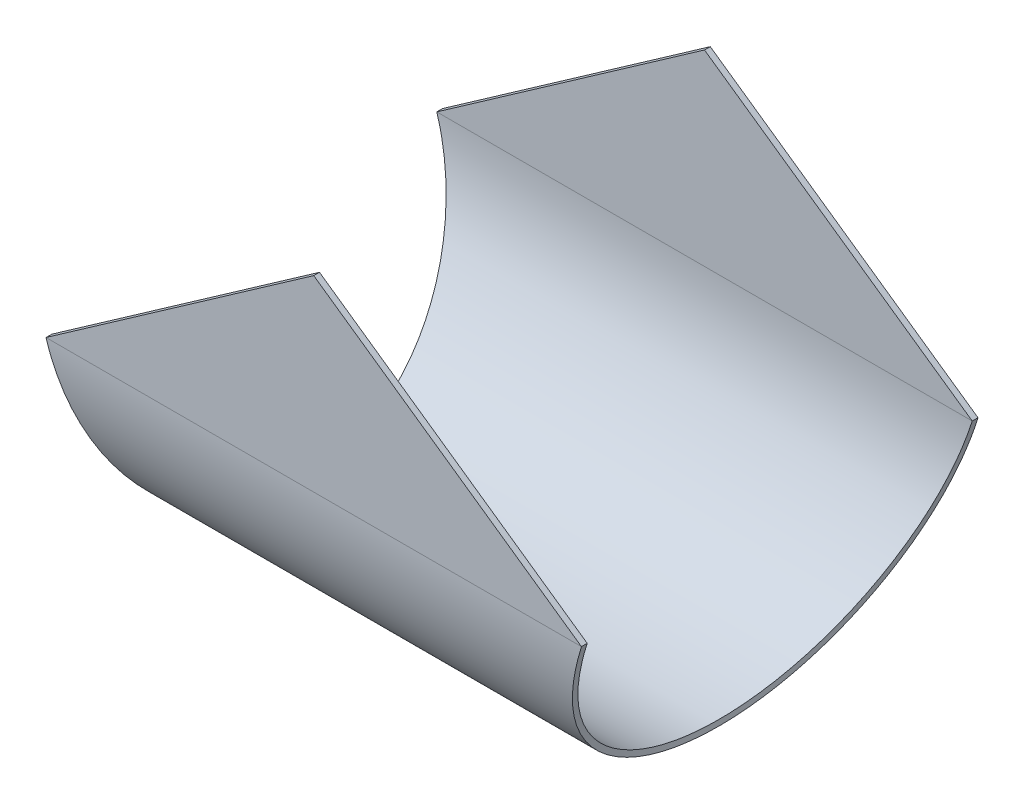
ISO-10303-21;
HEADER;
FILE_DESCRIPTION(('STEP AP214'),'2;1');
FILE_NAME('part.step','',(''),(''),'','','');
FILE_SCHEMA(('AUTOMOTIVE_DESIGN { 1 0 10303 214 1 1 1 1 }'));
ENDSEC;
DATA;
#1=APPLICATION_CONTEXT('core data for automotive mechanical design processes');
#2=APPLICATION_PROTOCOL_DEFINITION('international standard','automotive_design',2000,#1);
#3=PRODUCT_CONTEXT('',#1,'mechanical');
#4=PRODUCT('Part','Part','',(#3));
#5=PRODUCT_RELATED_PRODUCT_CATEGORY('part','',(#4));
#6=PRODUCT_DEFINITION_FORMATION('','',#4);
#7=PRODUCT_DEFINITION_CONTEXT('part definition',#1,'design');
#8=PRODUCT_DEFINITION('design','',#6,#7);
#9=PRODUCT_DEFINITION_SHAPE('','',#8);
#10=(LENGTH_UNIT() NAMED_UNIT(*) SI_UNIT(.MILLI.,.METRE.));
#11=(NAMED_UNIT(*) PLANE_ANGLE_UNIT() SI_UNIT($,.RADIAN.));
#12=(NAMED_UNIT(*) SI_UNIT($,.STERADIAN.) SOLID_ANGLE_UNIT());
#13=UNCERTAINTY_MEASURE_WITH_UNIT(LENGTH_MEASURE(1.E-05),#10,'distance_accuracy_value','');
#14=(GEOMETRIC_REPRESENTATION_CONTEXT(3) GLOBAL_UNCERTAINTY_ASSIGNED_CONTEXT((#13)) GLOBAL_UNIT_ASSIGNED_CONTEXT((#10,
#11,#12)) REPRESENTATION_CONTEXT('',''));
#15=CARTESIAN_POINT('',(0.,0.,0.));
#16=DIRECTION('',(0.,0.,1.));
#17=DIRECTION('',(1.,0.,0.));
#18=AXIS2_PLACEMENT_3D('',#15,#16,#17);
#19=CARTESIAN_POINT('',(0.,6.66133814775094E-13,-275.));
#20=DIRECTION('',(0.,0.,1.));
#21=DIRECTION('',(-1.,0.,0.));
#22=AXIS2_PLACEMENT_3D('',#19,#20,#21);
#23=PLANE('',#22);
#24=DIRECTION('',(-0.819152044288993,-0.573576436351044,0.));
#25=VECTOR('',#24,1.);
#26=CARTESIAN_POINT('',(-371.318481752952,-259.999999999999,-275.));
#27=LINE('',#26,#25);
#28=CARTESIAN_POINT('',(0.,6.66133814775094E-13,-275.));
#29=VERTEX_POINT('',#28);
#30=CARTESIAN_POINT('',(-371.318481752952,-259.999999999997,-274.999999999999));
#31=VERTEX_POINT('',#30);
#32=EDGE_CURVE('E55',#29,#31,#27,.T.);
#33=ORIENTED_EDGE('',*,*,#32,.F.);
#34=DIRECTION('',(-0.819152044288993,0.573576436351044,0.));
#35=VECTOR('',#34,1.);
#36=CARTESIAN_POINT('',(0.,6.66133814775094E-13,-275.));
#37=LINE('',#36,#35);
#38=CARTESIAN_POINT('',(371.318481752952,-259.999999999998,-275.));
#39=VERTEX_POINT('',#38);
#40=EDGE_CURVE('E105',#39,#29,#37,.T.);
#41=ORIENTED_EDGE('',*,*,#40,.F.);
#42=DIRECTION('',(-1.,0.,0.));
#43=VECTOR('',#42,1.);
#44=CARTESIAN_POINT('',(3410.86627632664,-259.999999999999,-275.000000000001));
#45=LINE('',#44,#43);
#46=EDGE_CURVE('E95',#39,#31,#45,.T.);
#47=ORIENTED_EDGE('',*,*,#46,.T.);
#48=EDGE_LOOP('',(#33,#41,#47));
#49=FACE_BOUND('',#48,.T.);
#50=ADVANCED_FACE('F37',(#49),#23,.F.);
#51=CARTESIAN_POINT('',(-371.318481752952,-259.999999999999,1306.67043508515));
#52=DIRECTION('',(0.573576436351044,-0.819152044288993,0.));
#53=DIRECTION('',(-0.819152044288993,-0.573576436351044,0.));
#54=AXIS2_PLACEMENT_3D('',#51,#52,#53);
#55=PLANE('',#54);
#56=DIRECTION('',(0.,0.,-1.));
#57=VECTOR('',#56,1.);
#58=CARTESIAN_POINT('',(1.39832694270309E-13,6.66133814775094E-13,1306.67043508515));
#59=LINE('',#58,#57);
#60=CARTESIAN_POINT('',(0.,6.66133814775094E-13,-267.));
#61=VERTEX_POINT('',#60);
#62=EDGE_CURVE('E62',#61,#29,#59,.T.);
#63=ORIENTED_EDGE('',*,*,#62,.T.);
#64=ORIENTED_EDGE('',*,*,#32,.T.);
#65=CARTESIAN_POINT('',(-371.318481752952,-259.999999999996,-267.));
#66=CARTESIAN_POINT('',(-371.318481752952,-259.999999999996,-275.));
#67=B_SPLINE_CURVE_WITH_KNOTS('',1,(#65,#66),.UNSPECIFIED.,.F.,.F.,(2,2),(0.,1.),.UNSPECIFIED.);
#68=CARTESIAN_POINT('',(-371.318481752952,-259.999999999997,-267.));
#69=VERTEX_POINT('',#68);
#70=EDGE_CURVE('E13',#69,#31,#67,.T.);
#71=ORIENTED_EDGE('',*,*,#70,.F.);
#72=DIRECTION('',(-0.819152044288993,-0.573576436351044,0.));
#73=VECTOR('',#72,1.);
#74=CARTESIAN_POINT('',(-371.318481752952,-259.999999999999,-267.));
#75=LINE('',#74,#73);
#76=EDGE_CURVE('E104',#61,#69,#75,.T.);
#77=ORIENTED_EDGE('',*,*,#76,.F.);
#78=EDGE_LOOP('',(#63,#64,#71,#77));
#79=FACE_BOUND('',#78,.T.);
#80=ADVANCED_FACE('F39',(#79),#55,.F.);
#81=CARTESIAN_POINT('',(1.39832694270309E-13,6.66133814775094E-13,1306.67043508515));
#82=DIRECTION('',(-0.573576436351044,-0.819152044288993,0.));
#83=DIRECTION('',(-0.819152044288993,0.573576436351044,0.));
#84=AXIS2_PLACEMENT_3D('',#81,#82,#83);
#85=PLANE('',#84);
#86=CARTESIAN_POINT('',(371.318481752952,-259.999999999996,-275.));
#87=CARTESIAN_POINT('',(371.318481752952,-259.999999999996,-267.));
#88=B_SPLINE_CURVE_WITH_KNOTS('',1,(#86,#87),.UNSPECIFIED.,.F.,.F.,(2,2),(0.,1.),.UNSPECIFIED.);
#89=CARTESIAN_POINT('',(371.318481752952,-259.999999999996,-267.));
#90=VERTEX_POINT('',#89);
#91=EDGE_CURVE('E48',#90,#39,#88,.F.);
#92=ORIENTED_EDGE('',*,*,#91,.T.);
#93=ORIENTED_EDGE('',*,*,#40,.T.);
#94=ORIENTED_EDGE('',*,*,#62,.F.);
#95=DIRECTION('',(-0.819152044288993,0.573576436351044,0.));
#96=VECTOR('',#95,1.);
#97=CARTESIAN_POINT('',(0.,6.66133814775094E-13,-267.));
#98=LINE('',#97,#96);
#99=EDGE_CURVE('E123',#90,#61,#98,.T.);
#100=ORIENTED_EDGE('',*,*,#99,.F.);
#101=EDGE_LOOP('',(#92,#93,#94,#100));
#102=FACE_BOUND('',#101,.T.);
#103=ADVANCED_FACE('F121',(#102),#85,.F.);
#104=CARTESIAN_POINT('',(0.,6.66133814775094E-13,-267.));
#105=DIRECTION('',(0.,0.,1.));
#106=DIRECTION('',(-1.,0.,0.));
#107=AXIS2_PLACEMENT_3D('',#104,#105,#106);
#108=PLANE('',#107);
#109=ORIENTED_EDGE('',*,*,#76,.T.);
#110=DIRECTION('',(1.,0.,0.));
#111=VECTOR('',#110,1.);
#112=CARTESIAN_POINT('',(-371.318481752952,-259.999999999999,-267.));
#113=LINE('',#112,#111);
#114=EDGE_CURVE('E273',#69,#90,#113,.T.);
#115=ORIENTED_EDGE('',*,*,#114,.T.);
#116=ORIENTED_EDGE('',*,*,#99,.T.);
#117=EDGE_LOOP('',(#109,#115,#116));
#118=FACE_BOUND('',#117,.T.);
#119=ADVANCED_FACE('F140',(#118),#108,.T.);
#120=CARTESIAN_POINT('',(0.,0.,267.));
#121=DIRECTION('',(0.,0.,-1.));
#122=DIRECTION('',(-1.,0.,0.));
#123=AXIS2_PLACEMENT_3D('',#120,#121,#122);
#124=PLANE('',#123);
#125=DIRECTION('',(-0.819152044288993,-0.573576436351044,0.));
#126=VECTOR('',#125,1.);
#127=CARTESIAN_POINT('',(-371.318481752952,-260.,267.));
#128=LINE('',#127,#126);
#129=CARTESIAN_POINT('',(0.,0.,266.999999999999));
#130=VERTEX_POINT('',#129);
#131=CARTESIAN_POINT('',(-371.318481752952,-259.999999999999,267.));
#132=VERTEX_POINT('',#131);
#133=EDGE_CURVE('E208',#130,#132,#128,.T.);
#134=ORIENTED_EDGE('',*,*,#133,.F.);
#135=DIRECTION('',(-0.819152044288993,0.573576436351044,0.));
#136=VECTOR('',#135,1.);
#137=CARTESIAN_POINT('',(0.,0.,267.));
#138=LINE('',#137,#136);
#139=CARTESIAN_POINT('',(371.318481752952,-259.999999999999,267.));
#140=VERTEX_POINT('',#139);
#141=EDGE_CURVE('E168',#140,#130,#138,.T.);
#142=ORIENTED_EDGE('',*,*,#141,.F.);
#143=DIRECTION('',(1.,0.,0.));
#144=VECTOR('',#143,1.);
#145=CARTESIAN_POINT('',(-371.318481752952,-260.,267.));
#146=LINE('',#145,#144);
#147=EDGE_CURVE('E192',#140,#132,#146,.F.);
#148=ORIENTED_EDGE('',*,*,#147,.T.);
#149=EDGE_LOOP('',(#134,#142,#148));
#150=FACE_BOUND('',#149,.T.);
#151=ADVANCED_FACE('F143',(#150),#124,.T.);
#152=CARTESIAN_POINT('',(-371.318481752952,-260.,-1306.67043508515));
#153=DIRECTION('',(-0.573576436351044,0.819152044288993,0.));
#154=DIRECTION('',(-0.819152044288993,-0.573576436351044,0.));
#155=AXIS2_PLACEMENT_3D('',#152,#153,#154);
#156=PLANE('',#155);
#157=DIRECTION('',(-0.819152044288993,-0.573576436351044,0.));
#158=VECTOR('',#157,1.);
#159=CARTESIAN_POINT('',(-371.318481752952,-260.,275.));
#160=LINE('',#159,#158);
#161=CARTESIAN_POINT('',(0.,0.,275.));
#162=VERTEX_POINT('',#161);
#163=CARTESIAN_POINT('',(-371.318481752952,-259.999999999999,274.999999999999));
#164=VERTEX_POINT('',#163);
#165=EDGE_CURVE('E169',#162,#164,#160,.T.);
#166=ORIENTED_EDGE('',*,*,#165,.F.);
#167=DIRECTION('',(0.,0.,1.));
#168=VECTOR('',#167,1.);
#169=CARTESIAN_POINT('',(0.,0.,-1306.67043508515));
#170=LINE('',#169,#168);
#171=EDGE_CURVE('E176',#130,#162,#170,.T.);
#172=ORIENTED_EDGE('',*,*,#171,.F.);
#173=ORIENTED_EDGE('',*,*,#133,.T.);
#174=CARTESIAN_POINT('',(-371.318481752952,-259.999999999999,275.));
#175=CARTESIAN_POINT('',(-371.318481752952,-259.999999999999,267.));
#176=B_SPLINE_CURVE_WITH_KNOTS('',1,(#174,#175),.UNSPECIFIED.,.F.,.F.,(2,2),(0.,1.),.UNSPECIFIED.);
#177=EDGE_CURVE('E197',#132,#164,#176,.F.);
#178=ORIENTED_EDGE('',*,*,#177,.T.);
#179=EDGE_LOOP('',(#166,#172,#173,#178));
#180=FACE_BOUND('',#179,.T.);
#181=ADVANCED_FACE('F210',(#180),#156,.T.);
#182=CARTESIAN_POINT('',(0.,0.,275.));
#183=DIRECTION('',(0.,0.,-1.));
#184=DIRECTION('',(-1.,0.,0.));
#185=AXIS2_PLACEMENT_3D('',#182,#183,#184);
#186=PLANE('',#185);
#187=ORIENTED_EDGE('',*,*,#165,.T.);
#188=DIRECTION('',(-1.,0.,0.));
#189=VECTOR('',#188,1.);
#190=CARTESIAN_POINT('',(3410.86627632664,-260.,275.));
#191=LINE('',#190,#189);
#192=CARTESIAN_POINT('',(371.318481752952,-259.999999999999,275.));
#193=VERTEX_POINT('',#192);
#194=EDGE_CURVE('E190',#193,#164,#191,.T.);
#195=ORIENTED_EDGE('',*,*,#194,.F.);
#196=DIRECTION('',(-0.819152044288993,0.573576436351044,0.));
#197=VECTOR('',#196,1.);
#198=CARTESIAN_POINT('',(0.,0.,275.));
#199=LINE('',#198,#197);
#200=EDGE_CURVE('E161',#193,#162,#199,.T.);
#201=ORIENTED_EDGE('',*,*,#200,.T.);
#202=EDGE_LOOP('',(#187,#195,#201));
#203=FACE_BOUND('',#202,.T.);
#204=ADVANCED_FACE('F152',(#203),#186,.F.);
#205=CARTESIAN_POINT('',(0.,0.,-1306.67043508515));
#206=DIRECTION('',(0.573576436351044,0.819152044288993,0.));
#207=DIRECTION('',(-0.819152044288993,0.573576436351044,0.));
#208=AXIS2_PLACEMENT_3D('',#205,#206,#207);
#209=PLANE('',#208);
#210=ORIENTED_EDGE('',*,*,#200,.F.);
#211=CARTESIAN_POINT('',(371.318481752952,-259.999999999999,267.));
#212=CARTESIAN_POINT('',(371.318481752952,-259.999999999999,275.));
#213=B_SPLINE_CURVE_WITH_KNOTS('',1,(#211,#212),.UNSPECIFIED.,.F.,.F.,(2,2),(0.,1.),.UNSPECIFIED.);
#214=EDGE_CURVE('E114',#140,#193,#213,.T.);
#215=ORIENTED_EDGE('',*,*,#214,.F.);
#216=ORIENTED_EDGE('',*,*,#141,.T.);
#217=ORIENTED_EDGE('',*,*,#171,.T.);
#218=EDGE_LOOP('',(#210,#215,#216,#217));
#219=FACE_BOUND('',#218,.T.);
#220=ADVANCED_FACE('F147',(#219),#209,.T.);
#221=CARTESIAN_POINT('',(-371.318481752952,-259.999999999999,275.));
#222=CARTESIAN_POINT('',(-368.88598371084,-267.946060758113,275.));
#223=CARTESIAN_POINT('',(-366.867882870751,-274.541143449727,274.665547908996));
#224=CARTESIAN_POINT('',(-364.862007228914,-281.092050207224,274.1930905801));
#225=CARTESIAN_POINT('',(-364.486690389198,-282.31768513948,274.095298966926));
#226=CARTESIAN_POINT('',(-363.9625025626,-284.029551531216,273.948733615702));
#227=CARTESIAN_POINT('',(-363.794237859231,-284.579076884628,273.899891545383));
#228=CARTESIAN_POINT('',(-363.470637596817,-285.635981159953,273.802991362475));
#229=CARTESIAN_POINT('',(-363.316871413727,-286.138249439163,273.755434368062));
#230=CARTESIAN_POINT('',(-362.561383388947,-288.606160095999,273.515305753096));
#231=CARTESIAN_POINT('',(-361.969905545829,-290.538456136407,273.305736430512));
#232=CARTESIAN_POINT('',(-360.234209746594,-296.208766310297,272.632383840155));
#233=CARTESIAN_POINT('',(-359.128729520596,-299.820123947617,272.12406688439));
#234=CARTESIAN_POINT('',(-357.547984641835,-304.983556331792,271.30152445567));
#235=CARTESIAN_POINT('',(-357.033982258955,-306.662453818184,271.017304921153));
#236=CARTESIAN_POINT('',(-356.031802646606,-309.935920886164,270.433296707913));
#237=CARTESIAN_POINT('',(-355.545143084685,-311.525552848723,270.134486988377));
#238=CARTESIAN_POINT('',(-353.15933324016,-319.319172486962,268.60121795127));
#239=CARTESIAN_POINT('',(-351.343503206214,-325.251306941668,267.210024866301));
#240=CARTESIAN_POINT('',(-348.758984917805,-333.693573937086,264.95799624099));
#241=CARTESIAN_POINT('',(-347.922370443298,-336.426282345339,264.181360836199));
#242=CARTESIAN_POINT('',(-346.288065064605,-341.764982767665,262.57809436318));
#243=CARTESIAN_POINT('',(-345.48551406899,-344.386749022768,261.746515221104));
#244=CARTESIAN_POINT('',(-343.121666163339,-352.108768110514,259.172570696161));
#245=CARTESIAN_POINT('',(-341.604174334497,-357.065591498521,257.351116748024));
#246=CARTESIAN_POINT('',(-338.686004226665,-366.597951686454,253.551184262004));
#247=CARTESIAN_POINT('',(-337.275532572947,-371.20573877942,251.560322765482));
#248=CARTESIAN_POINT('',(-334.536750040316,-380.152319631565,247.412070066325));
#249=CARTESIAN_POINT('',(-333.212267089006,-384.478641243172,245.260267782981));
#250=CARTESIAN_POINT('',(-330.643873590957,-392.868695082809,240.818273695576));
#251=CARTESIAN_POINT('',(-329.395300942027,-396.947481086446,238.519759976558));
#252=CARTESIAN_POINT('',(-326.969403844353,-404.871906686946,233.791400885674));
#253=CARTESIAN_POINT('',(-325.793702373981,-408.712166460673,231.365196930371));
#254=CARTESIAN_POINT('',(-323.505754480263,-416.186507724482,226.386699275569));
#255=CARTESIAN_POINT('',(-322.391445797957,-419.827282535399,223.829502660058));
#256=CARTESIAN_POINT('',(-319.137515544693,-430.458224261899,215.978285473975));
#257=CARTESIAN_POINT('',(-317.086889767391,-437.156509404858,210.504917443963));
#258=CARTESIAN_POINT('',(-313.222960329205,-449.776225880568,199.202743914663));
#259=CARTESIAN_POINT('',(-311.413076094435,-455.688548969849,193.386410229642));
#260=CARTESIAN_POINT('',(-307.990862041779,-466.86926588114,181.376455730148));
#261=CARTESIAN_POINT('',(-306.382830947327,-472.122352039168,175.194684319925));
#262=CARTESIAN_POINT('',(-303.372920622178,-481.953292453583,162.560159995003));
#263=CARTESIAN_POINT('',(-301.973402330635,-486.524168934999,156.118806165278));
#264=CARTESIAN_POINT('',(-299.367356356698,-495.038368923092,142.979879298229));
#265=CARTESIAN_POINT('',(-298.160224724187,-498.982414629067,136.278544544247));
#266=CARTESIAN_POINT('',(-295.937744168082,-506.24206275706,122.675518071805));
#267=CARTESIAN_POINT('',(-294.922395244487,-509.557682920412,115.77384307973));
#268=CARTESIAN_POINT('',(-293.083480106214,-515.564190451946,101.831058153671));
#269=CARTESIAN_POINT('',(-292.257402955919,-518.263648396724,94.7707923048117));
#270=CARTESIAN_POINT('',(-290.789497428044,-523.059437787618,80.5068155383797));
#271=CARTESIAN_POINT('',(-290.148072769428,-525.154438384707,73.306198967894));
#272=CARTESIAN_POINT('',(-289.050279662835,-528.739417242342,58.8200698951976));
#273=CARTESIAN_POINT('',(-288.594244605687,-530.228906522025,51.5402034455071));
#274=CARTESIAN_POINT('',(-287.498993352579,-533.807999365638,29.5702121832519));
#275=CARTESIAN_POINT('',(-287.133841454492,-534.999564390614,14.7693931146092));
#276=CARTESIAN_POINT('',(-287.133568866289,-535.000435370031,-14.753166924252));
#277=CARTESIAN_POINT('',(-287.498452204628,-533.80974831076,-29.5539993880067));
#278=CARTESIAN_POINT('',(-288.593306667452,-530.231965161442,-51.5241622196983));
#279=CARTESIAN_POINT('',(-289.049210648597,-528.74291181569,-58.8040925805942));
#280=CARTESIAN_POINT('',(-290.146729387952,-525.158831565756,-73.2902994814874));
#281=CARTESIAN_POINT('',(-290.788012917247,-523.064289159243,-80.4909506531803));
#282=CARTESIAN_POINT('',(-292.255628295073,-518.269441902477,-94.7549932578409));
#283=CARTESIAN_POINT('',(-293.081560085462,-515.57045592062,-101.815317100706));
#284=CARTESIAN_POINT('',(-294.920160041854,-509.564979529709,-115.758100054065));
#285=CARTESIAN_POINT('',(-295.93535073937,-506.249881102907,-122.659812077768));
#286=CARTESIAN_POINT('',(-298.157513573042,-498.991278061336,-136.262990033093));
#287=CARTESIAN_POINT('',(-299.364485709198,-495.047755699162,-142.964439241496));
#288=CARTESIAN_POINT('',(-301.970211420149,-486.534592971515,-156.103672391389));
#289=CARTESIAN_POINT('',(-303.369557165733,-481.964270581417,-162.545162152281));
#290=CARTESIAN_POINT('',(-306.379146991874,-472.134382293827,-175.180110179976));
#291=CARTESIAN_POINT('',(-307.987025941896,-466.881800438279,-181.362154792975));
#292=CARTESIAN_POINT('',(-311.408951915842,-455.702026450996,-193.372767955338));
#293=CARTESIAN_POINT('',(-313.218688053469,-449.790174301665,-199.189450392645));
#294=CARTESIAN_POINT('',(-317.082328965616,-437.171401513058,-210.492379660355));
#295=CARTESIAN_POINT('',(-319.132826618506,-430.473543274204,-215.966194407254));
#296=CARTESIAN_POINT('',(-322.386588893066,-419.84315366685,-223.818168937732));
#297=CARTESIAN_POINT('',(-323.500845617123,-416.202548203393,-226.375632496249));
#298=CARTESIAN_POINT('',(-325.788697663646,-408.72851301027,-231.354689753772));
#299=CARTESIAN_POINT('',(-326.964335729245,-404.888459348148,-233.781144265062));
#300=CARTESIAN_POINT('',(-329.390165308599,-396.964257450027,-238.510128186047));
#301=CARTESIAN_POINT('',(-330.638722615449,-392.885523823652,-240.808991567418));
#302=CARTESIAN_POINT('',(-333.207122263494,-384.495445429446,-245.251741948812));
#303=CARTESIAN_POINT('',(-334.531597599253,-380.169148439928,-247.403902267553));
#304=CARTESIAN_POINT('',(-337.270451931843,-371.222336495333,-251.552990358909));
#305=CARTESIAN_POINT('',(-338.68100942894,-366.614268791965,-253.544330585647));
#306=CARTESIAN_POINT('',(-341.599300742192,-357.081507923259,-257.345119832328));
#307=CARTESIAN_POINT('',(-343.116897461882,-352.124345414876,-259.167046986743));
#308=CARTESIAN_POINT('',(-345.480969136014,-344.401597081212,-261.741730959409));
#309=CARTESIAN_POINT('',(-346.283605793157,-341.779551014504,-262.573561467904));
#310=CARTESIAN_POINT('',(-347.918104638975,-336.440215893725,-264.177333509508));
#311=CARTESIAN_POINT('',(-348.754781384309,-333.707302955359,-264.954181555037));
#312=CARTESIAN_POINT('',(-351.33960360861,-325.264044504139,-267.206930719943));
#313=CARTESIAN_POINT('',(-353.155709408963,-319.331012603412,-268.598631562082));
#314=CARTESIAN_POINT('',(-355.541955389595,-311.53596537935,-270.132502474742));
#315=CARTESIAN_POINT('',(-356.02865831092,-309.946190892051,-270.431401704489));
#316=CARTESIAN_POINT('',(-357.030985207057,-306.672242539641,-271.015620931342));
#317=CARTESIAN_POINT('',(-357.545071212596,-304.993072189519,-271.299948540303));
#318=CARTESIAN_POINT('',(-359.126096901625,-299.828723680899,-272.122816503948));
#319=CARTESIAN_POINT('',(-360.231804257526,-296.216625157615,-272.631352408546));
#320=CARTESIAN_POINT('',(-361.9679006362,-290.545006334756,-273.305007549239));
#321=CARTESIAN_POINT('',(-362.559521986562,-288.612241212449,-273.514673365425));
#322=CARTESIAN_POINT('',(-363.315201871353,-286.143703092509,-273.754913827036));
#323=CARTESIAN_POINT('',(-363.468949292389,-285.641495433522,-273.802475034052));
#324=CARTESIAN_POINT('',(-363.792556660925,-284.584567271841,-273.899398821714));
#325=CARTESIAN_POINT('',(-363.960829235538,-284.035015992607,-273.948254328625));
#326=CARTESIAN_POINT('',(-364.485053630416,-282.323029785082,-274.094864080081));
#327=CARTESIAN_POINT('',(-364.860412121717,-281.097258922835,-274.192690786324));
#328=CARTESIAN_POINT('',(-366.866582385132,-274.545391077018,-274.665337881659));
#329=CARTESIAN_POINT('',(-368.885194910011,-267.948637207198,-275.));
#330=CARTESIAN_POINT('',(-371.318481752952,-259.999999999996,-275.));
#331=CARTESIAN_POINT('',(-371.318481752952,-259.999999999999,267.));
#332=CARTESIAN_POINT('',(-368.885985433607,-267.714897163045,267.));
#333=CARTESIAN_POINT('',(-366.867882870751,-274.118128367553,266.675277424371));
#334=CARTESIAN_POINT('',(-364.862007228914,-280.478463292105,266.216564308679));
#335=CARTESIAN_POINT('',(-364.486690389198,-281.668443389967,266.121617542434));
#336=CARTESIAN_POINT('',(-363.9625025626,-283.330510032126,265.979315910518));
#337=CARTESIAN_POINT('',(-363.794237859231,-283.864049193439,265.931894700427));
#338=CARTESIAN_POINT('',(-363.470637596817,-284.890207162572,265.83781343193));
#339=CARTESIAN_POINT('',(-363.316871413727,-285.377864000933,265.791639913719));
#340=CARTESIAN_POINT('',(-362.561383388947,-287.773980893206,265.558496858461));
#341=CARTESIAN_POINT('',(-361.969905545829,-289.650064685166,265.355024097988));
#342=CARTESIAN_POINT('',(-360.234209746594,-295.15542038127,264.701259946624));
#343=CARTESIAN_POINT('',(-359.128729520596,-298.661720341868,264.207730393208));
#344=CARTESIAN_POINT('',(-357.547984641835,-303.674943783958,263.409116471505));
#345=CARTESIAN_POINT('',(-357.033982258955,-305.305000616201,263.133165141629));
#346=CARTESIAN_POINT('',(-356.031802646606,-308.483239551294,262.566146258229));
#347=CARTESIAN_POINT('',(-355.545143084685,-310.026627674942,262.276029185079));
#348=CARTESIAN_POINT('',(-353.15933324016,-317.593523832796,260.787364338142));
#349=CARTESIAN_POINT('',(-351.343503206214,-323.353087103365,259.436642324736));
#350=CARTESIAN_POINT('',(-348.758984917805,-331.549760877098,257.250127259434));
#351=CARTESIAN_POINT('',(-347.922370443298,-334.202972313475,256.496084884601));
#352=CARTESIAN_POINT('',(-346.288065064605,-339.386365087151,254.939458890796));
#353=CARTESIAN_POINT('',(-345.48551406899,-341.931861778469,254.132071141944));
#354=CARTESIAN_POINT('',(-343.121666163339,-349.429240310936,251.633005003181));
#355=CARTESIAN_POINT('',(-341.604174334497,-354.241865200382,249.864538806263));
#356=CARTESIAN_POINT('',(-338.686004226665,-363.496920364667,246.175149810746));
#357=CARTESIAN_POINT('',(-337.275532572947,-367.9706627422,244.242204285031));
#358=CARTESIAN_POINT('',(-334.536750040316,-376.656979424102,240.214628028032));
#359=CARTESIAN_POINT('',(-333.212267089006,-380.857444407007,238.125423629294));
#360=CARTESIAN_POINT('',(-330.643873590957,-389.003423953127,233.812651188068));
#361=CARTESIAN_POINT('',(-329.395300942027,-392.963554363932,231.581003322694));
#362=CARTESIAN_POINT('',(-326.969403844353,-400.65745121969,226.990196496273));
#363=CARTESIAN_POINT('',(-325.793702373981,-404.385994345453,224.63457301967));
#364=CARTESIAN_POINT('',(-323.505754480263,-411.642900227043,219.800904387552));
#365=CARTESIAN_POINT('',(-322.391445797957,-415.177761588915,217.318098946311));
#366=CARTESIAN_POINT('',(-319.137515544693,-425.499439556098,209.695280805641));
#367=CARTESIAN_POINT('',(-317.086889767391,-432.002865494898,204.381138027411));
#368=CARTESIAN_POINT('',(-313.222960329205,-444.255462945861,193.407755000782));
#369=CARTESIAN_POINT('',(-311.413076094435,-449.995791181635,187.760623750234));
#370=CARTESIAN_POINT('',(-307.990862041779,-460.851250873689,176.100049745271));
#371=CARTESIAN_POINT('',(-306.382830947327,-465.951519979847,170.098111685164));
#372=CARTESIAN_POINT('',(-303.372920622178,-475.496469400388,157.831137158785));
#373=CARTESIAN_POINT('',(-301.973402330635,-479.934374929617,151.577168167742));
#374=CARTESIAN_POINT('',(-299.367356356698,-488.200889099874,138.820464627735));
#375=CARTESIAN_POINT('',(-298.160224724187,-492.030198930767,132.314077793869));
#376=CARTESIAN_POINT('',(-295.937744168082,-499.078657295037,119.106775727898));
#377=CARTESIAN_POINT('',(-294.922395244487,-502.297823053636,112.405876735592));
#378=CARTESIAN_POINT('',(-293.083480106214,-508.129595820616,98.8687000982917));
#379=CARTESIAN_POINT('',(-292.257402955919,-510.750524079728,92.013823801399));
#380=CARTESIAN_POINT('',(-290.789497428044,-515.406799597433,78.1647990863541));
#381=CARTESIAN_POINT('',(-290.148072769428,-517.440854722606,71.1736549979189));
#382=CARTESIAN_POINT('',(-289.050279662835,-520.921543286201,57.1089405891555));
#383=CARTESIAN_POINT('',(-288.594244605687,-522.367701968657,50.0408520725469));
#384=CARTESIAN_POINT('',(-287.498993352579,-525.842675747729,28.70998782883));
#385=CARTESIAN_POINT('',(-287.133841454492,-526.999577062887,14.3397380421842));
#386=CARTESIAN_POINT('',(-287.133568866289,-527.000422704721,-14.3239838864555));
#387=CARTESIAN_POINT('',(-287.498452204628,-525.844373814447,-28.6942466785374));
#388=CARTESIAN_POINT('',(-288.593306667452,-522.370671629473,-50.0252775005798));
#389=CARTESIAN_POINT('',(-289.049210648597,-520.924936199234,-57.0934280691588));
#390=CARTESIAN_POINT('',(-290.146729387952,-517.445120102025,-71.158218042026));
#391=CARTESIAN_POINT('',(-290.788012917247,-515.411509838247,-78.1493957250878));
#392=CARTESIAN_POINT('',(-292.255628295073,-510.756149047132,-91.9984843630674));
#393=CARTESIAN_POINT('',(-293.081560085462,-508.135679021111,-98.8534169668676));
#394=CARTESIAN_POINT('',(-294.920160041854,-502.304907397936,-112.390591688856));
#395=CARTESIAN_POINT('',(-295.93535073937,-499.086248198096,-119.091526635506));
#396=CARTESIAN_POINT('',(-298.157513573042,-492.038804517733,-132.298975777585));
#397=CARTESIAN_POINT('',(-299.364485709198,-488.210002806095,-138.805473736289));
#398=CARTESIAN_POINT('',(-301.970211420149,-479.944495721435,-151.562474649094));
#399=CARTESIAN_POINT('',(-303.369557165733,-475.507128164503,-157.816575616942));
#400=CARTESIAN_POINT('',(-306.379146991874,-465.963200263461,-170.083961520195));
#401=CARTESIAN_POINT('',(-307.987025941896,-460.863420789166,-176.086164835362));
#402=CARTESIAN_POINT('',(-311.408951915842,-450.008876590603,-187.747378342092));
#403=CARTESIAN_POINT('',(-313.218688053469,-444.269005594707,-193.394848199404));
#404=CARTESIAN_POINT('',(-317.082328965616,-432.017324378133,-204.368964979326));
#405=CARTESIAN_POINT('',(-319.132826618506,-425.514312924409,-209.683541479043));
#406=CARTESIAN_POINT('',(-322.386588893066,-415.193171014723,-217.30709493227));
#407=CARTESIAN_POINT('',(-323.500845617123,-411.65847407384,-219.790159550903));
#408=CARTESIAN_POINT('',(-325.788697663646,-404.401865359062,-224.62437150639));
#409=CARTESIAN_POINT('',(-326.964335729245,-400.673522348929,-226.980238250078));
#410=CARTESIAN_POINT('',(-329.390165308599,-392.979842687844,-231.571651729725));
#411=CARTESIAN_POINT('',(-330.638722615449,-389.0197631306,-233.803639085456));
#412=CARTESIAN_POINT('',(-333.207122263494,-380.873759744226,-238.117145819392));
#413=CARTESIAN_POINT('',(-334.531597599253,-376.67331866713,-240.206697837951));
#414=CARTESIAN_POINT('',(-337.270451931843,-367.986777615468,-244.235085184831));
#415=CARTESIAN_POINT('',(-338.68100942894,-363.512762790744,-246.168495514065));
#416=CARTESIAN_POINT('',(-341.599300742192,-354.257318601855,-249.858716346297));
#417=CARTESIAN_POINT('',(-343.116897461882,-349.444364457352,-251.627641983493));
#418=CARTESIAN_POINT('',(-345.480969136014,-341.946277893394,-254.127426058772));
#419=CARTESIAN_POINT('',(-346.283605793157,-339.400509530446,-254.935057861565));
#420=CARTESIAN_POINT('',(-347.918104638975,-334.216500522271,-256.492174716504));
#421=CARTESIAN_POINT('',(-348.754781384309,-331.563090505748,-257.246423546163));
#422=CARTESIAN_POINT('',(-351.33960360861,-323.365454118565,-259.433638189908));
#423=CARTESIAN_POINT('',(-353.155709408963,-317.605019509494,-260.784853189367));
#424=CARTESIAN_POINT('',(-355.541955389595,-310.036737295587,-262.274102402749));
#425=CARTESIAN_POINT('',(-356.02865831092,-308.493210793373,-262.564306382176));
#426=CARTESIAN_POINT('',(-357.030985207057,-305.314504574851,-263.131530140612));
#427=CARTESIAN_POINT('',(-357.545071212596,-303.684182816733,-263.407586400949));
#428=CARTESIAN_POINT('',(-359.126096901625,-298.670069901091,-264.206516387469));
#429=CARTESIAN_POINT('',(-360.231804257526,-295.163050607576,-264.700258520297));
#430=CARTESIAN_POINT('',(-361.9679006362,-289.65642433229,-265.354316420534));
#431=CARTESIAN_POINT('',(-362.559521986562,-287.77988510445,-265.557882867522));
#432=CARTESIAN_POINT('',(-363.315201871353,-285.383159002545,-265.791134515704));
#433=CARTESIAN_POINT('',(-363.468949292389,-284.895561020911,-265.83731212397));
#434=CARTESIAN_POINT('',(-363.792556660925,-283.869379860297,-265.931416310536));
#435=CARTESIAN_POINT('',(-363.960829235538,-283.335815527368,-265.978850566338));
#436=CARTESIAN_POINT('',(-364.485053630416,-281.67363255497,-266.121195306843));
#437=CARTESIAN_POINT('',(-364.860412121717,-280.483520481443,-266.216176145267));
#438=CARTESIAN_POINT('',(-366.866582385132,-274.122252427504,-266.67507350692));
#439=CARTESIAN_POINT('',(-368.885196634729,-267.717398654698,-267.));
#440=CARTESIAN_POINT('',(-371.318481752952,-259.999999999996,-267.));
#441=B_SPLINE_SURFACE_WITH_KNOTS('',1,3,((#221,#222,#223,#224,#225,#226,#227,#228,#229,#230,
#231,#232,#233,#234,#235,#236,#237,#238,#239,#240,#241,#242,#243,#244,#245,#246,#247,#248,#249,
#250,#251,#252,#253,#254,#255,#256,#257,#258,#259,#260,#261,#262,#263,#264,#265,#266,#267,#268,
#269,#270,#271,#272,#273,#274,#275,#276,#277,#278,#279,#280,#281,#282,#283,#284,#285,#286,#287,
#288,#289,#290,#291,#292,#293,#294,#295,#296,#297,#298,#299,#300,#301,#302,#303,#304,#305,#306,
#307,#308,#309,#310,#311,#312,#313,#314,#315,#316,#317,#318,#319,#320,#321,#322,#323,#324,#325,
#326,#327,#328,#329,#330),(#331,#332,#333,#334,#335,#336,#337,#338,#339,#340,#341,#342,#343,
#344,#345,#346,#347,#348,#349,#350,#351,#352,#353,#354,#355,#356,#357,#358,#359,#360,#361,#362,
#363,#364,#365,#366,#367,#368,#369,#370,#371,#372,#373,#374,#375,#376,#377,#378,#379,#380,#381,
#382,#383,#384,#385,#386,#387,#388,#389,#390,#391,#392,#393,#394,#395,#396,#397,#398,#399,#400,
#401,#402,#403,#404,#405,#406,#407,#408,#409,#410,#411,#412,#413,#414,#415,#416,#417,#418,#419,
#420,#421,#422,#423,#424,#425,#426,#427,#428,#429,#430,#431,#432,#433,#434,#435,#436,#437,#438,
#439,#440)),.UNSPECIFIED.,.F.,.F.,.F.,(2,2),(4,2,2,2,2,2,2,2,2,2,2,2,2,2,2,2,2,2,2,2,2,2,2,2,2,
2,2,2,2,2,2,2,2,2,2,2,2,2,2,2,2,2,2,2,2,2,2,2,2,2,2,2,2,2,4),(0.,1.),(0.,0.0078125,0.009765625,
0.0107421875,0.01171875,0.015625,0.0234375,0.02734375,0.03125,0.046875,0.0546875,0.0625,
0.078125,0.09375,0.109375,0.125,0.140625,0.15625,0.1875,0.21875,0.25,0.28125,0.3125,0.34375,
0.375,0.40625,0.4375,0.5,0.5625,0.59375,0.625,0.65625,0.6875,0.71875,0.75,0.78125,0.8125,
0.84375,0.859375,0.875,0.890625,0.90625,0.921875,0.9375,0.9453125,0.953125,0.96875,0.97265625,
0.9765625,0.984375,0.98828125,0.9892578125,0.990234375,0.9921875,1.),.UNSPECIFIED.);
#442=CARTESIAN_POINT('',(-371.318481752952,-259.999999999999,267.));
#443=CARTESIAN_POINT('',(-368.885985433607,-267.714897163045,267.));
#444=CARTESIAN_POINT('',(-366.867882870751,-274.118128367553,266.675277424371));
#445=CARTESIAN_POINT('',(-364.862007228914,-280.478463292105,266.216564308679));
#446=CARTESIAN_POINT('',(-364.486690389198,-281.668443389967,266.121617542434));
#447=CARTESIAN_POINT('',(-363.9625025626,-283.330510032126,265.979315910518));
#448=CARTESIAN_POINT('',(-363.794237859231,-283.864049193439,265.931894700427));
#449=CARTESIAN_POINT('',(-363.470637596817,-284.890207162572,265.83781343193));
#450=CARTESIAN_POINT('',(-363.316871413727,-285.377864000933,265.791639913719));
#451=CARTESIAN_POINT('',(-362.561383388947,-287.773980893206,265.558496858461));
#452=CARTESIAN_POINT('',(-361.969905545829,-289.650064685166,265.355024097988));
#453=CARTESIAN_POINT('',(-360.234209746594,-295.15542038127,264.701259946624));
#454=CARTESIAN_POINT('',(-359.128729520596,-298.661720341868,264.207730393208));
#455=CARTESIAN_POINT('',(-357.547984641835,-303.674943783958,263.409116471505));
#456=CARTESIAN_POINT('',(-357.033982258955,-305.305000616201,263.133165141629));
#457=CARTESIAN_POINT('',(-356.031802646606,-308.483239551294,262.566146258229));
#458=CARTESIAN_POINT('',(-355.545143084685,-310.026627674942,262.276029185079));
#459=CARTESIAN_POINT('',(-353.15933324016,-317.593523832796,260.787364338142));
#460=CARTESIAN_POINT('',(-351.343503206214,-323.353087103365,259.436642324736));
#461=CARTESIAN_POINT('',(-348.758984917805,-331.549760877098,257.250127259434));
#462=CARTESIAN_POINT('',(-347.922370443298,-334.202972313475,256.496084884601));
#463=CARTESIAN_POINT('',(-346.288065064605,-339.386365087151,254.939458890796));
#464=CARTESIAN_POINT('',(-345.48551406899,-341.931861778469,254.132071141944));
#465=CARTESIAN_POINT('',(-343.121666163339,-349.429240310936,251.633005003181));
#466=CARTESIAN_POINT('',(-341.604174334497,-354.241865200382,249.864538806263));
#467=CARTESIAN_POINT('',(-338.686004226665,-363.496920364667,246.175149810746));
#468=CARTESIAN_POINT('',(-337.275532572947,-367.9706627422,244.242204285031));
#469=CARTESIAN_POINT('',(-334.536750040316,-376.656979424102,240.214628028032));
#470=CARTESIAN_POINT('',(-333.212267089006,-380.857444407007,238.125423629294));
#471=CARTESIAN_POINT('',(-330.643873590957,-389.003423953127,233.812651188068));
#472=CARTESIAN_POINT('',(-329.395300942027,-392.963554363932,231.581003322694));
#473=CARTESIAN_POINT('',(-326.969403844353,-400.65745121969,226.990196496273));
#474=CARTESIAN_POINT('',(-325.793702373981,-404.385994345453,224.63457301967));
#475=CARTESIAN_POINT('',(-323.505754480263,-411.642900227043,219.800904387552));
#476=CARTESIAN_POINT('',(-322.391445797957,-415.177761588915,217.318098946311));
#477=CARTESIAN_POINT('',(-319.137515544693,-425.499439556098,209.695280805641));
#478=CARTESIAN_POINT('',(-317.086889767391,-432.002865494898,204.381138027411));
#479=CARTESIAN_POINT('',(-313.222960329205,-444.255462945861,193.407755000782));
#480=CARTESIAN_POINT('',(-311.413076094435,-449.995791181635,187.760623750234));
#481=CARTESIAN_POINT('',(-307.990862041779,-460.851250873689,176.100049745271));
#482=CARTESIAN_POINT('',(-306.382830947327,-465.951519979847,170.098111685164));
#483=CARTESIAN_POINT('',(-303.372920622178,-475.496469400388,157.831137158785));
#484=CARTESIAN_POINT('',(-301.973402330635,-479.934374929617,151.577168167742));
#485=CARTESIAN_POINT('',(-299.367356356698,-488.200889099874,138.820464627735));
#486=CARTESIAN_POINT('',(-298.160224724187,-492.030198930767,132.314077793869));
#487=CARTESIAN_POINT('',(-295.937744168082,-499.078657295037,119.106775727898));
#488=CARTESIAN_POINT('',(-294.922395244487,-502.297823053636,112.405876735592));
#489=CARTESIAN_POINT('',(-293.083480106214,-508.129595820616,98.8687000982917));
#490=CARTESIAN_POINT('',(-292.257402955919,-510.750524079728,92.013823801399));
#491=CARTESIAN_POINT('',(-290.789497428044,-515.406799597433,78.1647990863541));
#492=CARTESIAN_POINT('',(-290.148072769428,-517.440854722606,71.1736549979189));
#493=CARTESIAN_POINT('',(-289.050279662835,-520.921543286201,57.1089405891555));
#494=CARTESIAN_POINT('',(-288.594244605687,-522.367701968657,50.0408520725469));
#495=CARTESIAN_POINT('',(-287.498993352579,-525.842675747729,28.70998782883));
#496=CARTESIAN_POINT('',(-287.133841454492,-526.999577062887,14.3397380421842));
#497=CARTESIAN_POINT('',(-287.133568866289,-527.000422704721,-14.3239838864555));
#498=CARTESIAN_POINT('',(-287.498452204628,-525.844373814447,-28.6942466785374));
#499=CARTESIAN_POINT('',(-288.593306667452,-522.370671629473,-50.0252775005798));
#500=CARTESIAN_POINT('',(-289.049210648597,-520.924936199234,-57.0934280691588));
#501=CARTESIAN_POINT('',(-290.146729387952,-517.445120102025,-71.158218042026));
#502=CARTESIAN_POINT('',(-290.788012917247,-515.411509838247,-78.1493957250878));
#503=CARTESIAN_POINT('',(-292.255628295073,-510.756149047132,-91.9984843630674));
#504=CARTESIAN_POINT('',(-293.081560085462,-508.135679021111,-98.8534169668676));
#505=CARTESIAN_POINT('',(-294.920160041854,-502.304907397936,-112.390591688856));
#506=CARTESIAN_POINT('',(-295.93535073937,-499.086248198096,-119.091526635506));
#507=CARTESIAN_POINT('',(-298.157513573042,-492.038804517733,-132.298975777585));
#508=CARTESIAN_POINT('',(-299.364485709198,-488.210002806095,-138.805473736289));
#509=CARTESIAN_POINT('',(-301.970211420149,-479.944495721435,-151.562474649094));
#510=CARTESIAN_POINT('',(-303.369557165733,-475.507128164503,-157.816575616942));
#511=CARTESIAN_POINT('',(-306.379146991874,-465.963200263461,-170.083961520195));
#512=CARTESIAN_POINT('',(-307.987025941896,-460.863420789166,-176.086164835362));
#513=CARTESIAN_POINT('',(-311.408951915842,-450.008876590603,-187.747378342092));
#514=CARTESIAN_POINT('',(-313.218688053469,-444.269005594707,-193.394848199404));
#515=CARTESIAN_POINT('',(-317.082328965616,-432.017324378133,-204.368964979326));
#516=CARTESIAN_POINT('',(-319.132826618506,-425.514312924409,-209.683541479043));
#517=CARTESIAN_POINT('',(-322.386588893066,-415.193171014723,-217.30709493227));
#518=CARTESIAN_POINT('',(-323.500845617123,-411.65847407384,-219.790159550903));
#519=CARTESIAN_POINT('',(-325.788697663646,-404.401865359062,-224.62437150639));
#520=CARTESIAN_POINT('',(-326.964335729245,-400.673522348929,-226.980238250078));
#521=CARTESIAN_POINT('',(-329.390165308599,-392.979842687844,-231.571651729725));
#522=CARTESIAN_POINT('',(-330.638722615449,-389.0197631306,-233.803639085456));
#523=CARTESIAN_POINT('',(-333.207122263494,-380.873759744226,-238.117145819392));
#524=CARTESIAN_POINT('',(-334.531597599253,-376.67331866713,-240.206697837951));
#525=CARTESIAN_POINT('',(-337.270451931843,-367.986777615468,-244.235085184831));
#526=CARTESIAN_POINT('',(-338.68100942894,-363.512762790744,-246.168495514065));
#527=CARTESIAN_POINT('',(-341.599300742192,-354.257318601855,-249.858716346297));
#528=CARTESIAN_POINT('',(-343.116897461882,-349.444364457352,-251.627641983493));
#529=CARTESIAN_POINT('',(-345.480969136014,-341.946277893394,-254.127426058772));
#530=CARTESIAN_POINT('',(-346.283605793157,-339.400509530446,-254.935057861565));
#531=CARTESIAN_POINT('',(-347.918104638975,-334.216500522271,-256.492174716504));
#532=CARTESIAN_POINT('',(-348.754781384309,-331.563090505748,-257.246423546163));
#533=CARTESIAN_POINT('',(-351.33960360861,-323.365454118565,-259.433638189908));
#534=CARTESIAN_POINT('',(-353.155709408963,-317.605019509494,-260.784853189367));
#535=CARTESIAN_POINT('',(-355.541955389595,-310.036737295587,-262.274102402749));
#536=CARTESIAN_POINT('',(-356.02865831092,-308.493210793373,-262.564306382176));
#537=CARTESIAN_POINT('',(-357.030985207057,-305.314504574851,-263.131530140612));
#538=CARTESIAN_POINT('',(-357.545071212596,-303.684182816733,-263.407586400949));
#539=CARTESIAN_POINT('',(-359.126096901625,-298.670069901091,-264.206516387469));
#540=CARTESIAN_POINT('',(-360.231804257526,-295.163050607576,-264.700258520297));
#541=CARTESIAN_POINT('',(-361.9679006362,-289.65642433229,-265.354316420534));
#542=CARTESIAN_POINT('',(-362.559521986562,-287.77988510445,-265.557882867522));
#543=CARTESIAN_POINT('',(-363.315201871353,-285.383159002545,-265.791134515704));
#544=CARTESIAN_POINT('',(-363.468949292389,-284.895561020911,-265.83731212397));
#545=CARTESIAN_POINT('',(-363.792556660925,-283.869379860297,-265.931416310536));
#546=CARTESIAN_POINT('',(-363.960829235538,-283.335815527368,-265.978850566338));
#547=CARTESIAN_POINT('',(-364.485053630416,-281.67363255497,-266.121195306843));
#548=CARTESIAN_POINT('',(-364.860412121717,-280.483520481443,-266.216176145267));
#549=CARTESIAN_POINT('',(-366.866582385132,-274.122252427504,-266.67507350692));
#550=CARTESIAN_POINT('',(-368.885196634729,-267.717398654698,-267.));
#551=CARTESIAN_POINT('',(-371.318481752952,-259.999999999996,-267.));
#552=B_SPLINE_CURVE_WITH_KNOTS('',3,(#442,#443,#444,#445,#446,#447,#448,#449,#450,#451,#452,
#453,#454,#455,#456,#457,#458,#459,#460,#461,#462,#463,#464,#465,#466,#467,#468,#469,#470,#471,
#472,#473,#474,#475,#476,#477,#478,#479,#480,#481,#482,#483,#484,#485,#486,#487,#488,#489,#490,
#491,#492,#493,#494,#495,#496,#497,#498,#499,#500,#501,#502,#503,#504,#505,#506,#507,#508,#509,
#510,#511,#512,#513,#514,#515,#516,#517,#518,#519,#520,#521,#522,#523,#524,#525,#526,#527,#528,
#529,#530,#531,#532,#533,#534,#535,#536,#537,#538,#539,#540,#541,#542,#543,#544,#545,#546,#547,
#548,#549,#550,#551),.UNSPECIFIED.,.F.,.F.,(4,2,2,2,2,2,2,2,2,2,2,2,2,2,2,2,2,2,2,2,2,2,2,2,2,2,
2,2,2,2,2,2,2,2,2,2,2,2,2,2,2,2,2,2,2,2,2,2,2,2,2,2,2,2,4),(0.,0.0078125,0.009765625,
0.0107421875,0.01171875,0.015625,0.0234375,0.02734375,0.03125,0.046875,0.0546875,0.0625,
0.078125,0.09375,0.109375,0.125,0.140625,0.15625,0.1875,0.21875,0.25,0.28125,0.3125,0.34375,
0.375,0.40625,0.4375,0.5,0.5625,0.59375,0.625,0.65625,0.6875,0.71875,0.75,0.78125,0.8125,
0.84375,0.859375,0.875,0.890625,0.90625,0.921875,0.9375,0.9453125,0.953125,0.96875,0.97265625,
0.9765625,0.984375,0.98828125,0.9892578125,0.990234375,0.9921875,1.),.UNSPECIFIED.);
#553=EDGE_CURVE('E116',#132,#69,#552,.T.);
#554=CARTESIAN_POINT('',(-371.318481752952,-259.999999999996,-275.));
#555=CARTESIAN_POINT('',(-368.885194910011,-267.948637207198,-275.));
#556=CARTESIAN_POINT('',(-366.866582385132,-274.545391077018,-274.665337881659));
#557=CARTESIAN_POINT('',(-364.860412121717,-281.097258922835,-274.192690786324));
#558=CARTESIAN_POINT('',(-364.485053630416,-282.323029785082,-274.094864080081));
#559=CARTESIAN_POINT('',(-363.960829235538,-284.035015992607,-273.948254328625));
#560=CARTESIAN_POINT('',(-363.792556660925,-284.584567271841,-273.899398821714));
#561=CARTESIAN_POINT('',(-363.468949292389,-285.641495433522,-273.802475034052));
#562=CARTESIAN_POINT('',(-363.315201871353,-286.143703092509,-273.754913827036));
#563=CARTESIAN_POINT('',(-362.559521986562,-288.612241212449,-273.514673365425));
#564=CARTESIAN_POINT('',(-361.9679006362,-290.545006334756,-273.305007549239));
#565=CARTESIAN_POINT('',(-360.231804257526,-296.216625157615,-272.631352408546));
#566=CARTESIAN_POINT('',(-359.126096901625,-299.828723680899,-272.122816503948));
#567=CARTESIAN_POINT('',(-357.545071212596,-304.993072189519,-271.299948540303));
#568=CARTESIAN_POINT('',(-357.030985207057,-306.672242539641,-271.015620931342));
#569=CARTESIAN_POINT('',(-356.02865831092,-309.946190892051,-270.431401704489));
#570=CARTESIAN_POINT('',(-355.541955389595,-311.53596537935,-270.132502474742));
#571=CARTESIAN_POINT('',(-353.155709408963,-319.331012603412,-268.598631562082));
#572=CARTESIAN_POINT('',(-351.33960360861,-325.264044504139,-267.206930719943));
#573=CARTESIAN_POINT('',(-348.754781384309,-333.707302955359,-264.954181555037));
#574=CARTESIAN_POINT('',(-347.918104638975,-336.440215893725,-264.177333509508));
#575=CARTESIAN_POINT('',(-346.283605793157,-341.779551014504,-262.573561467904));
#576=CARTESIAN_POINT('',(-345.480969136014,-344.401597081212,-261.741730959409));
#577=CARTESIAN_POINT('',(-343.116897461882,-352.124345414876,-259.167046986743));
#578=CARTESIAN_POINT('',(-341.599300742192,-357.081507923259,-257.345119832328));
#579=CARTESIAN_POINT('',(-338.68100942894,-366.614268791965,-253.544330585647));
#580=CARTESIAN_POINT('',(-337.270451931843,-371.222336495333,-251.552990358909));
#581=CARTESIAN_POINT('',(-334.531597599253,-380.169148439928,-247.403902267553));
#582=CARTESIAN_POINT('',(-333.207122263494,-384.495445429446,-245.251741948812));
#583=CARTESIAN_POINT('',(-330.638722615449,-392.885523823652,-240.808991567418));
#584=CARTESIAN_POINT('',(-329.390165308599,-396.964257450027,-238.510128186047));
#585=CARTESIAN_POINT('',(-326.964335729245,-404.888459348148,-233.781144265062));
#586=CARTESIAN_POINT('',(-325.788697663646,-408.72851301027,-231.354689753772));
#587=CARTESIAN_POINT('',(-323.500845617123,-416.202548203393,-226.375632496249));
#588=CARTESIAN_POINT('',(-322.386588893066,-419.84315366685,-223.818168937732));
#589=CARTESIAN_POINT('',(-319.132826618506,-430.473543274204,-215.966194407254));
#590=CARTESIAN_POINT('',(-317.082328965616,-437.171401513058,-210.492379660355));
#591=CARTESIAN_POINT('',(-313.218688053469,-449.790174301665,-199.189450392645));
#592=CARTESIAN_POINT('',(-311.408951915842,-455.702026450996,-193.372767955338));
#593=CARTESIAN_POINT('',(-307.987025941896,-466.881800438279,-181.362154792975));
#594=CARTESIAN_POINT('',(-306.379146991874,-472.134382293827,-175.180110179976));
#595=CARTESIAN_POINT('',(-303.369557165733,-481.964270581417,-162.545162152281));
#596=CARTESIAN_POINT('',(-301.970211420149,-486.534592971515,-156.103672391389));
#597=CARTESIAN_POINT('',(-299.364485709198,-495.047755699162,-142.964439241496));
#598=CARTESIAN_POINT('',(-298.157513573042,-498.991278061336,-136.262990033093));
#599=CARTESIAN_POINT('',(-295.93535073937,-506.249881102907,-122.659812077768));
#600=CARTESIAN_POINT('',(-294.920160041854,-509.564979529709,-115.758100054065));
#601=CARTESIAN_POINT('',(-293.081560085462,-515.57045592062,-101.815317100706));
#602=CARTESIAN_POINT('',(-292.255628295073,-518.269441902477,-94.7549932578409));
#603=CARTESIAN_POINT('',(-290.788012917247,-523.064289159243,-80.4909506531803));
#604=CARTESIAN_POINT('',(-290.146729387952,-525.158831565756,-73.2902994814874));
#605=CARTESIAN_POINT('',(-289.049210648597,-528.74291181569,-58.8040925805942));
#606=CARTESIAN_POINT('',(-288.593306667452,-530.231965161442,-51.5241622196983));
#607=CARTESIAN_POINT('',(-287.498452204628,-533.80974831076,-29.5539993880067));
#608=CARTESIAN_POINT('',(-287.133568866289,-535.000435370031,-14.753166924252));
#609=CARTESIAN_POINT('',(-287.133841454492,-534.999564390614,14.7693931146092));
#610=CARTESIAN_POINT('',(-287.498993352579,-533.807999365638,29.5702121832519));
#611=CARTESIAN_POINT('',(-288.594244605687,-530.228906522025,51.5402034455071));
#612=CARTESIAN_POINT('',(-289.050279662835,-528.739417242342,58.8200698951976));
#613=CARTESIAN_POINT('',(-290.148072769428,-525.154438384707,73.306198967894));
#614=CARTESIAN_POINT('',(-290.789497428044,-523.059437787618,80.5068155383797));
#615=CARTESIAN_POINT('',(-292.257402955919,-518.263648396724,94.7707923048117));
#616=CARTESIAN_POINT('',(-293.083480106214,-515.564190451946,101.831058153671));
#617=CARTESIAN_POINT('',(-294.922395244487,-509.557682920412,115.77384307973));
#618=CARTESIAN_POINT('',(-295.937744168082,-506.24206275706,122.675518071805));
#619=CARTESIAN_POINT('',(-298.160224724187,-498.982414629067,136.278544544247));
#620=CARTESIAN_POINT('',(-299.367356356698,-495.038368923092,142.979879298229));
#621=CARTESIAN_POINT('',(-301.973402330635,-486.524168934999,156.118806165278));
#622=CARTESIAN_POINT('',(-303.372920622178,-481.953292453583,162.560159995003));
#623=CARTESIAN_POINT('',(-306.382830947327,-472.122352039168,175.194684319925));
#624=CARTESIAN_POINT('',(-307.990862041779,-466.86926588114,181.376455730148));
#625=CARTESIAN_POINT('',(-311.413076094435,-455.688548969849,193.386410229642));
#626=CARTESIAN_POINT('',(-313.222960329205,-449.776225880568,199.202743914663));
#627=CARTESIAN_POINT('',(-317.086889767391,-437.156509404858,210.504917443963));
#628=CARTESIAN_POINT('',(-319.137515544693,-430.458224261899,215.978285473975));
#629=CARTESIAN_POINT('',(-322.391445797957,-419.827282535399,223.829502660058));
#630=CARTESIAN_POINT('',(-323.505754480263,-416.186507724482,226.386699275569));
#631=CARTESIAN_POINT('',(-325.793702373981,-408.712166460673,231.365196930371));
#632=CARTESIAN_POINT('',(-326.969403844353,-404.871906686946,233.791400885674));
#633=CARTESIAN_POINT('',(-329.395300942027,-396.947481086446,238.519759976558));
#634=CARTESIAN_POINT('',(-330.643873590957,-392.868695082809,240.818273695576));
#635=CARTESIAN_POINT('',(-333.212267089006,-384.478641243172,245.260267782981));
#636=CARTESIAN_POINT('',(-334.536750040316,-380.152319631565,247.412070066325));
#637=CARTESIAN_POINT('',(-337.275532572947,-371.20573877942,251.560322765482));
#638=CARTESIAN_POINT('',(-338.686004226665,-366.597951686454,253.551184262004));
#639=CARTESIAN_POINT('',(-341.604174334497,-357.065591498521,257.351116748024));
#640=CARTESIAN_POINT('',(-343.121666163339,-352.108768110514,259.172570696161));
#641=CARTESIAN_POINT('',(-345.48551406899,-344.386749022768,261.746515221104));
#642=CARTESIAN_POINT('',(-346.288065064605,-341.764982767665,262.57809436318));
#643=CARTESIAN_POINT('',(-347.922370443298,-336.426282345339,264.181360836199));
#644=CARTESIAN_POINT('',(-348.758984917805,-333.693573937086,264.95799624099));
#645=CARTESIAN_POINT('',(-351.343503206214,-325.251306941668,267.210024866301));
#646=CARTESIAN_POINT('',(-353.15933324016,-319.319172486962,268.60121795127));
#647=CARTESIAN_POINT('',(-355.545143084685,-311.525552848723,270.134486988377));
#648=CARTESIAN_POINT('',(-356.031802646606,-309.935920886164,270.433296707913));
#649=CARTESIAN_POINT('',(-357.033982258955,-306.662453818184,271.017304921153));
#650=CARTESIAN_POINT('',(-357.547984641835,-304.983556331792,271.30152445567));
#651=CARTESIAN_POINT('',(-359.128729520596,-299.820123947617,272.12406688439));
#652=CARTESIAN_POINT('',(-360.234209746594,-296.208766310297,272.632383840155));
#653=CARTESIAN_POINT('',(-361.969905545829,-290.538456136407,273.305736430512));
#654=CARTESIAN_POINT('',(-362.561383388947,-288.606160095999,273.515305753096));
#655=CARTESIAN_POINT('',(-363.316871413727,-286.138249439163,273.755434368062));
#656=CARTESIAN_POINT('',(-363.470637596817,-285.635981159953,273.802991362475));
#657=CARTESIAN_POINT('',(-363.794237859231,-284.579076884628,273.899891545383));
#658=CARTESIAN_POINT('',(-363.9625025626,-284.029551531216,273.948733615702));
#659=CARTESIAN_POINT('',(-364.486690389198,-282.31768513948,274.095298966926));
#660=CARTESIAN_POINT('',(-364.862007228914,-281.092050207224,274.1930905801));
#661=CARTESIAN_POINT('',(-366.867882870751,-274.541143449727,274.665547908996));
#662=CARTESIAN_POINT('',(-368.88598371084,-267.946060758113,275.));
#663=CARTESIAN_POINT('',(-371.318481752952,-259.999999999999,275.));
#664=B_SPLINE_CURVE_WITH_KNOTS('',3,(#554,#555,#556,#557,#558,#559,#560,#561,#562,#563,#564,
#565,#566,#567,#568,#569,#570,#571,#572,#573,#574,#575,#576,#577,#578,#579,#580,#581,#582,#583,
#584,#585,#586,#587,#588,#589,#590,#591,#592,#593,#594,#595,#596,#597,#598,#599,#600,#601,#602,
#603,#604,#605,#606,#607,#608,#609,#610,#611,#612,#613,#614,#615,#616,#617,#618,#619,#620,#621,
#622,#623,#624,#625,#626,#627,#628,#629,#630,#631,#632,#633,#634,#635,#636,#637,#638,#639,#640,
#641,#642,#643,#644,#645,#646,#647,#648,#649,#650,#651,#652,#653,#654,#655,#656,#657,#658,#659,
#660,#661,#662,#663),.UNSPECIFIED.,.F.,.F.,(4,2,2,2,2,2,2,2,2,2,2,2,2,2,2,2,2,2,2,2,2,2,2,2,2,2,
2,2,2,2,2,2,2,2,2,2,2,2,2,2,2,2,2,2,2,2,2,2,2,2,2,2,2,2,4),(0.,0.0078125,0.009765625,
0.0107421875,0.01171875,0.015625,0.0234375,0.02734375,0.03125,0.046875,0.0546875,0.0625,
0.078125,0.09375,0.109375,0.125,0.140625,0.15625,0.1875,0.21875,0.25,0.28125,0.3125,0.34375,
0.375,0.40625,0.4375,0.5,0.5625,0.59375,0.625,0.65625,0.6875,0.71875,0.75,0.78125,0.8125,
0.84375,0.859375,0.875,0.890625,0.90625,0.921875,0.9375,0.9453125,0.953125,0.96875,0.97265625,
0.9765625,0.984375,0.98828125,0.9892578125,0.990234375,0.9921875,1.),.UNSPECIFIED.);
#665=EDGE_CURVE('E102',#164,#31,#664,.F.);
#666=ORIENTED_EDGE('',*,*,#177,.F.);
#667=ORIENTED_EDGE('',*,*,#553,.T.);
#668=ORIENTED_EDGE('',*,*,#70,.T.);
#669=ORIENTED_EDGE('',*,*,#665,.F.);
#670=EDGE_LOOP('',(#666,#667,#668,#669));
#671=FACE_BOUND('',#670,.T.);
#672=ADVANCED_FACE('F151',(#671),#441,.T.);
#673=CARTESIAN_POINT('',(371.318481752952,-259.999999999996,-275.));
#674=CARTESIAN_POINT('',(368.885984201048,-267.94605917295,-275.));
#675=CARTESIAN_POINT('',(366.867883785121,-274.541140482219,-274.665548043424));
#676=CARTESIAN_POINT('',(364.862008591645,-281.092045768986,-274.193090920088));
#677=CARTESIAN_POINT('',(364.486691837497,-282.317680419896,-274.095299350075));
#678=CARTESIAN_POINT('',(363.962504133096,-284.029546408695,-273.948734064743));
#679=CARTESIAN_POINT('',(363.794239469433,-284.579071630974,-273.899892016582));
#680=CARTESIAN_POINT('',(363.470639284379,-285.635975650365,-273.802991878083));
#681=CARTESIAN_POINT('',(363.316873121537,-286.138243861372,-273.755434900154));
#682=CARTESIAN_POINT('',(362.561385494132,-288.606153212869,-273.515306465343));
#683=CARTESIAN_POINT('',(361.969907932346,-290.538448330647,-273.305737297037));
#684=CARTESIAN_POINT('',(360.234212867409,-296.208756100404,-272.632385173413));
#685=CARTESIAN_POINT('',(359.128732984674,-299.820112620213,-272.124068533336));
#686=CARTESIAN_POINT('',(357.547988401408,-304.98354404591,-271.301526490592));
#687=CARTESIAN_POINT('',(357.033986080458,-306.662441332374,-271.017307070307));
#688=CARTESIAN_POINT('',(356.031806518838,-309.935908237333,-270.433299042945));
#689=CARTESIAN_POINT('',(355.545146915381,-311.525540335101,-270.134489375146));
#690=CARTESIAN_POINT('',(353.159337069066,-319.319159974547,-268.601220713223));
#691=CARTESIAN_POINT('',(351.343507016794,-325.251294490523,-267.210027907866));
#692=CARTESIAN_POINT('',(348.758988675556,-333.693561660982,-264.957999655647));
#693=CARTESIAN_POINT('',(347.922374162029,-336.426270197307,-264.18136435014));
#694=CARTESIAN_POINT('',(346.288068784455,-341.764970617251,-262.578098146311));
#695=CARTESIAN_POINT('',(345.485517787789,-344.386736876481,-261.746519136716));
#696=CARTESIAN_POINT('',(343.121669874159,-352.108755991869,-259.172575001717));
#697=CARTESIAN_POINT('',(341.604178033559,-357.065579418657,-257.351121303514));
#698=CARTESIAN_POINT('',(338.686007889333,-366.597939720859,-253.551189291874));
#699=CARTESIAN_POINT('',(337.275536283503,-371.205726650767,-251.560328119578));
#700=CARTESIAN_POINT('',(334.536753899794,-380.152307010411,-247.412076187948));
#701=CARTESIAN_POINT('',(333.212271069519,-384.478628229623,-245.260274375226));
#702=CARTESIAN_POINT('',(330.643877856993,-392.868681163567,-240.818281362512));
#703=CARTESIAN_POINT('',(329.395305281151,-396.947466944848,-238.519768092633));
#704=CARTESIAN_POINT('',(326.969408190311,-404.871892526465,-233.791409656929));
#705=CARTESIAN_POINT('',(325.793706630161,-408.71215256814,-231.365205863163));
#706=CARTESIAN_POINT('',(323.505758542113,-416.186494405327,-226.386708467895));
#707=CARTESIAN_POINT('',(322.39144975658,-419.827269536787,-223.829511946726));
#708=CARTESIAN_POINT('',(319.137519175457,-430.458212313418,-215.978294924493));
#709=CARTESIAN_POINT('',(317.086893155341,-437.15649827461,-210.504926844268));
#710=CARTESIAN_POINT('',(313.222963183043,-449.776216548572,-199.202752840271));
#711=CARTESIAN_POINT('',(311.413078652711,-455.688540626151,-193.386418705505));
#712=CARTESIAN_POINT('',(307.99086412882,-466.869259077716,-181.37646352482));
#713=CARTESIAN_POINT('',(306.382832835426,-472.122345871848,-175.194691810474));
#714=CARTESIAN_POINT('',(303.372922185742,-481.953287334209,-162.560167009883));
#715=CARTESIAN_POINT('',(301.973403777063,-486.524164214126,-156.118813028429));
#716=CARTESIAN_POINT('',(299.367357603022,-495.038364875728,-142.979885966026));
#717=CARTESIAN_POINT('',(298.160225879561,-498.982410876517,-136.278551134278));
#718=CARTESIAN_POINT('',(295.937745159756,-506.242059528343,-122.675524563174));
#719=CARTESIAN_POINT('',(294.922396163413,-509.557679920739,-115.773849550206));
#720=CARTESIAN_POINT('',(293.083480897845,-515.56418786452,-101.831064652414));
#721=CARTESIAN_POINT('',(292.257403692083,-518.26364598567,-94.7707988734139));
#722=CARTESIAN_POINT('',(290.789498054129,-523.059435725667,-80.5068222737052));
#723=CARTESIAN_POINT('',(290.148073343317,-525.15443648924,-73.3062058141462));
#724=CARTESIAN_POINT('',(289.050280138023,-528.739415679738,-58.8200770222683));
#725=CARTESIAN_POINT('',(288.594245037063,-530.22890512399,-51.5402107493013));
#726=CARTESIAN_POINT('',(287.49899362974,-533.807998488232,-29.5702201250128));
#727=CARTESIAN_POINT('',(287.133841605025,-534.99956390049,-14.769401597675));
#728=CARTESIAN_POINT('',(287.133568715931,-535.000435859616,14.7531571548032));
#729=CARTESIAN_POINT('',(287.498451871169,-533.809749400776,29.553988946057));
#730=CARTESIAN_POINT('',(288.593306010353,-530.231967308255,51.5241509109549));
#731=CARTESIAN_POINT('',(289.049209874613,-528.742914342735,58.8040809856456));
#732=CARTESIAN_POINT('',(290.146728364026,-525.158834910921,73.2902873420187));
#733=CARTESIAN_POINT('',(290.78801176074,-523.064292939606,80.4909382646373));
#734=CARTESIAN_POINT('',(292.255626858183,-518.269446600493,94.754980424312));
#735=CARTESIAN_POINT('',(293.081558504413,-515.570461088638,101.815304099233));
#736=CARTESIAN_POINT('',(294.920158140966,-509.564985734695,115.758086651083));
#737=CARTESIAN_POINT('',(295.935348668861,-506.249887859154,122.659798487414));
#738=CARTESIAN_POINT('',(298.157511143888,-498.991285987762,136.262976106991));
#739=CARTESIAN_POINT('',(299.364483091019,-495.047764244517,142.964425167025));
#740=CARTESIAN_POINT('',(301.97020840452,-486.534602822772,156.103658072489));
#741=CARTESIAN_POINT('',(303.36955392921,-481.964281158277,162.545147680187));
#742=CARTESIAN_POINT('',(306.379143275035,-472.134394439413,175.180095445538));
#743=CARTESIAN_POINT('',(307.987021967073,-466.881813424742,181.362139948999));
#744=CARTESIAN_POINT('',(311.408947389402,-455.702041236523,193.372752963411));
#745=CARTESIAN_POINT('',(313.218683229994,-449.790190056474,199.189435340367));
#746=CARTESIAN_POINT('',(317.082323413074,-437.171419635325,210.492364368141));
#747=CARTESIAN_POINT('',(319.132820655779,-430.473562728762,215.966179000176));
#748=CARTESIAN_POINT('',(322.386582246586,-419.84317536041,223.818153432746));
#749=CARTESIAN_POINT('',(323.500838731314,-416.202570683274,226.375616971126));
#750=CARTESIAN_POINT('',(325.788690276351,-408.728537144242,231.354674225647));
#751=CARTESIAN_POINT('',(326.964328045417,-404.888484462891,233.781128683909));
#752=CARTESIAN_POINT('',(329.390157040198,-396.964284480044,238.510112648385));
#753=CARTESIAN_POINT('',(330.638714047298,-392.885551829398,240.808976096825));
#754=CARTESIAN_POINT('',(333.20711308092,-384.495475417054,245.25172671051));
#755=CARTESIAN_POINT('',(334.531588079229,-380.16917952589,247.40388715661));
#756=CARTESIAN_POINT('',(337.270441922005,-371.222369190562,251.552975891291));
#757=CARTESIAN_POINT('',(338.680999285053,-366.614301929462,253.544316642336));
#758=CARTESIAN_POINT('',(341.599290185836,-357.081542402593,257.345106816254));
#759=CARTESIAN_POINT('',(343.116886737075,-352.124380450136,259.167034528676));
#760=CARTESIAN_POINT('',(345.480958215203,-344.401632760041,261.741719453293));
#761=CARTESIAN_POINT('',(346.283594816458,-341.779586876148,262.57355029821));
#762=CARTESIAN_POINT('',(347.918093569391,-336.440252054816,264.177323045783));
#763=CARTESIAN_POINT('',(348.754770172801,-333.7073395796,264.954171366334));
#764=CARTESIAN_POINT('',(351.339592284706,-325.264081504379,267.206921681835));
#765=CARTESIAN_POINT('',(353.155698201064,-319.331049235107,268.598623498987));
#766=CARTESIAN_POINT('',(355.541944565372,-311.5360007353,270.132495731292));
#767=CARTESIAN_POINT('',(356.028647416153,-309.946226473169,270.431395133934));
#768=CARTESIAN_POINT('',(357.030974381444,-306.672277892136,271.015614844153));
#769=CARTESIAN_POINT('',(357.545060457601,-304.993107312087,271.29994271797));
#770=CARTESIAN_POINT('',(359.126086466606,-299.828757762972,272.1228115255));
#771=CARTESIAN_POINT('',(360.231794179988,-296.216658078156,272.631348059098));
#772=CARTESIAN_POINT('',(361.967891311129,-290.54503679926,273.305004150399));
#773=CARTESIAN_POINT('',(362.559512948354,-288.612270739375,273.514670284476));
#774=CARTESIAN_POINT('',(363.315193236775,-286.143731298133,273.754911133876));
#775=CARTESIAN_POINT('',(363.468940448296,-285.641524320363,273.802472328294));
#776=CARTESIAN_POINT('',(363.79254765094,-284.584596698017,273.899396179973));
#777=CARTESIAN_POINT('',(363.96082017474,-284.035045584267,273.948251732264));
#778=CARTESIAN_POINT('',(364.485044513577,-282.323059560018,274.09486165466));
#779=CARTESIAN_POINT('',(364.86040309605,-281.097288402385,274.192688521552));
#780=CARTESIAN_POINT('',(366.866574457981,-274.545416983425,274.665336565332));
#781=CARTESIAN_POINT('',(368.885189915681,-267.948653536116,275.));
#782=CARTESIAN_POINT('',(371.318481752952,-259.999999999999,275.));
#783=CARTESIAN_POINT('',(371.318481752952,-259.999999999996,-267.));
#784=CARTESIAN_POINT('',(368.885985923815,-267.714895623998,-267.));
#785=CARTESIAN_POINT('',(366.867883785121,-274.118125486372,-266.675277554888));
#786=CARTESIAN_POINT('',(364.862008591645,-280.478458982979,-266.216564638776));
#787=CARTESIAN_POINT('',(364.486691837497,-281.668438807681,-266.121617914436));
#788=CARTESIAN_POINT('',(363.962504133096,-283.330505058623,-265.979316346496));
#789=CARTESIAN_POINT('',(363.794239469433,-283.864044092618,-265.931895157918));
#790=CARTESIAN_POINT('',(363.470639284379,-284.890201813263,-265.837813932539));
#791=CARTESIAN_POINT('',(363.316873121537,-285.377858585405,-265.791640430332));
#792=CARTESIAN_POINT('',(362.561385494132,-287.773974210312,-265.558497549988));
#793=CARTESIAN_POINT('',(361.969907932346,-289.650057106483,-265.355024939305));
#794=CARTESIAN_POINT('',(360.234212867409,-295.155410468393,-264.701261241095));
#795=CARTESIAN_POINT('',(359.128732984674,-298.661709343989,-264.207731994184));
#796=CARTESIAN_POINT('',(357.547988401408,-303.674931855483,-263.409118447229));
#797=CARTESIAN_POINT('',(357.033986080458,-305.304988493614,-263.133167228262));
#798=CARTESIAN_POINT('',(356.031806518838,-308.483227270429,-262.566148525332));
#799=CARTESIAN_POINT('',(355.545146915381,-310.026615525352,-262.276031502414));
#800=CARTESIAN_POINT('',(353.159337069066,-317.593511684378,-260.787367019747));
#801=CARTESIAN_POINT('',(351.343507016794,-323.353075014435,-259.436645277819));
#802=CARTESIAN_POINT('',(348.758988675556,-331.549748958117,-257.250130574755));
#803=CARTESIAN_POINT('',(347.922374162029,-334.20296051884,-256.496088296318));
#804=CARTESIAN_POINT('',(346.288068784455,-339.386353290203,-254.939462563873));
#805=CARTESIAN_POINT('',(345.485517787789,-341.931849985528,-254.132074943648));
#806=CARTESIAN_POINT('',(343.121669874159,-349.429228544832,-251.633009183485));
#807=CARTESIAN_POINT('',(341.604178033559,-354.241853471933,-249.86454322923));
#808=CARTESIAN_POINT('',(338.686007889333,-363.496908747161,-246.175154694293));
#809=CARTESIAN_POINT('',(337.275536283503,-367.970650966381,-244.242209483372));
#810=CARTESIAN_POINT('',(334.536753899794,-376.656967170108,-240.214633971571));
#811=CARTESIAN_POINT('',(333.212271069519,-380.857431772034,-238.125430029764));
#812=CARTESIAN_POINT('',(330.643877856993,-389.003410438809,-233.812658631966));
#813=CARTESIAN_POINT('',(329.395305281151,-392.963540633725,-231.581011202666));
#814=CARTESIAN_POINT('',(326.969408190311,-400.657437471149,-226.990205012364));
#815=CARTESIAN_POINT('',(325.793706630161,-404.385980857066,-224.634581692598));
#816=CARTESIAN_POINT('',(323.505758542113,-411.642887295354,-219.800913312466));
#817=CARTESIAN_POINT('',(322.39144975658,-415.177748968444,-217.318107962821));
#818=CARTESIAN_POINT('',(319.137519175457,-425.49942795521,-209.695289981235));
#819=CARTESIAN_POINT('',(317.086893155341,-432.00285468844,-204.381147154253));
#820=CARTESIAN_POINT('',(313.222963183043,-444.255453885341,-193.407763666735));
#821=CARTESIAN_POINT('',(311.413078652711,-449.995783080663,-187.760631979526));
#822=CARTESIAN_POINT('',(307.99086412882,-460.851244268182,-176.100057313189));
#823=CARTESIAN_POINT('',(306.382832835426,-465.95151399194,-170.098118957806));
#824=CARTESIAN_POINT('',(303.372922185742,-475.496464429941,-157.831143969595));
#825=CARTESIAN_POINT('',(301.973403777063,-479.934370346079,-151.577174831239));
#826=CARTESIAN_POINT('',(299.367357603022,-488.200885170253,-138.82047110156));
#827=CARTESIAN_POINT('',(298.160225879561,-492.030195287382,-132.31408419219));
#828=CARTESIAN_POINT('',(295.937745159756,-499.078654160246,-119.106782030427));
#829=CARTESIAN_POINT('',(294.922396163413,-502.297820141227,-112.405883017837));
#830=CARTESIAN_POINT('',(293.083480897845,-508.129593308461,-98.8687064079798));
#831=CARTESIAN_POINT('',(292.257403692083,-510.750521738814,-92.0138301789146));
#832=CARTESIAN_POINT('',(290.789498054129,-515.406797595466,-78.1648056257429));
#833=CARTESIAN_POINT('',(290.148073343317,-517.44085288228,-71.1736616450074));
#834=CARTESIAN_POINT('',(289.050280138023,-520.921541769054,-57.1089475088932));
#835=CARTESIAN_POINT('',(288.594245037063,-522.367700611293,-50.040859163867));
#836=CARTESIAN_POINT('',(287.49899362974,-525.842674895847,-28.7099955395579));
#837=CARTESIAN_POINT('',(287.133841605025,-526.999576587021,-14.3397462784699));
#838=CARTESIAN_POINT('',(287.133568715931,-527.000423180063,14.3239744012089));
#839=CARTESIAN_POINT('',(287.498451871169,-525.844374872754,28.6942365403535));
#840=CARTESIAN_POINT('',(288.593306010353,-522.370673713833,50.025266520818));
#841=CARTESIAN_POINT('',(289.049209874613,-520.924938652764,57.0934168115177));
#842=CARTESIAN_POINT('',(290.146728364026,-517.445123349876,71.1582062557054));
#843=CARTESIAN_POINT('',(290.78801176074,-515.411513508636,78.1493836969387));
#844=CARTESIAN_POINT('',(292.255626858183,-510.756153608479,91.9984719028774));
#845=CARTESIAN_POINT('',(293.081558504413,-508.135684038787,98.8534043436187));
#846=CARTESIAN_POINT('',(294.920158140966,-502.304913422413,112.390578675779));
#847=CARTESIAN_POINT('',(295.935348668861,-499.086254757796,119.091513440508));
#848=CARTESIAN_POINT('',(298.157511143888,-492.038812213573,132.298962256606));
#849=CARTESIAN_POINT('',(299.364483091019,-488.210011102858,138.805460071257));
#850=CARTESIAN_POINT('',(301.97020840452,-479.94450528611,151.562460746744));
#851=CARTESIAN_POINT('',(303.36955392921,-475.507138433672,157.816561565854));
#852=CARTESIAN_POINT('',(306.379143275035,-465.963212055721,170.083947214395));
#853=CARTESIAN_POINT('',(307.987021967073,-460.863433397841,176.08615042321));
#854=CARTESIAN_POINT('',(311.408947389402,-450.008890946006,187.747363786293));
#855=CARTESIAN_POINT('',(313.218683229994,-444.269020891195,193.394833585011));
#856=CARTESIAN_POINT('',(317.082323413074,-432.017341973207,204.368950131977));
#857=CARTESIAN_POINT('',(319.132820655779,-425.514331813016,209.683526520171));
#858=CARTESIAN_POINT('',(322.386582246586,-415.193192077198,217.307079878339));
#859=CARTESIAN_POINT('',(323.500838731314,-411.65849589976,219.790144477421));
#860=CARTESIAN_POINT('',(325.788690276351,-404.401888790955,224.624356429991));
#861=CARTESIAN_POINT('',(326.964328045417,-400.673546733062,226.980223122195));
#862=CARTESIAN_POINT('',(329.390157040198,-392.979868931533,231.571636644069));
#863=CARTESIAN_POINT('',(330.638714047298,-389.019790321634,233.803624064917));
#864=CARTESIAN_POINT('',(333.20711308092,-380.873788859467,238.117131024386));
#865=CARTESIAN_POINT('',(334.531588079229,-376.673348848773,240.206683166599));
#866=CARTESIAN_POINT('',(337.270441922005,-367.986809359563,244.23507113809));
#867=CARTESIAN_POINT('',(338.680999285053,-363.512794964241,246.168481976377));
#868=CARTESIAN_POINT('',(341.599290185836,-354.257352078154,249.858703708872));
#869=CARTESIAN_POINT('',(343.116886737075,-349.444398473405,251.627629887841));
#870=CARTESIAN_POINT('',(345.480958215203,-341.946312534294,254.127414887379));
#871=CARTESIAN_POINT('',(346.283594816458,-339.400544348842,254.935047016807));
#872=CARTESIAN_POINT('',(347.918093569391,-334.216535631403,256.492164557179));
#873=CARTESIAN_POINT('',(348.754770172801,-331.563126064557,257.246413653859));
#874=CARTESIAN_POINT('',(351.339592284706,-323.365490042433,259.433629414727));
#875=CARTESIAN_POINT('',(353.155698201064,-317.60505507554,260.784845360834));
#876=CARTESIAN_POINT('',(355.541944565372,-310.036771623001,262.274095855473));
#877=CARTESIAN_POINT('',(356.028647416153,-308.493245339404,262.564300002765));
#878=CARTESIAN_POINT('',(357.030974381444,-305.31453889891,263.131524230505));
#879=CARTESIAN_POINT('',(357.545060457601,-303.684216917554,263.407580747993));
#880=CARTESIAN_POINT('',(359.126086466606,-298.670102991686,264.206511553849));
#881=CARTESIAN_POINT('',(360.231794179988,-295.163082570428,264.700254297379));
#882=CARTESIAN_POINT('',(361.967891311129,-289.656453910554,265.354313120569));
#883=CARTESIAN_POINT('',(362.559512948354,-287.779913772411,265.5578798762));
#884=CARTESIAN_POINT('',(363.315193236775,-285.383186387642,265.791131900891));
#885=CARTESIAN_POINT('',(363.468940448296,-284.895589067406,265.837309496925));
#886=CARTESIAN_POINT('',(363.79254765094,-283.869408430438,265.931413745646));
#887=CARTESIAN_POINT('',(363.96082017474,-283.335844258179,265.978848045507));
#888=CARTESIAN_POINT('',(364.485044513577,-281.673661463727,266.121192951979));
#889=CARTESIAN_POINT('',(364.86040309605,-280.483549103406,266.21617394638));
#890=CARTESIAN_POINT('',(366.866574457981,-274.12227758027,266.675072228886));
#891=CARTESIAN_POINT('',(368.885191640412,-267.717414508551,267.));
#892=CARTESIAN_POINT('',(371.318481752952,-259.999999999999,267.));
#893=B_SPLINE_SURFACE_WITH_KNOTS('',1,3,((#673,#674,#675,#676,#677,#678,#679,#680,#681,#682,
#683,#684,#685,#686,#687,#688,#689,#690,#691,#692,#693,#694,#695,#696,#697,#698,#699,#700,#701,
#702,#703,#704,#705,#706,#707,#708,#709,#710,#711,#712,#713,#714,#715,#716,#717,#718,#719,#720,
#721,#722,#723,#724,#725,#726,#727,#728,#729,#730,#731,#732,#733,#734,#735,#736,#737,#738,#739,
#740,#741,#742,#743,#744,#745,#746,#747,#748,#749,#750,#751,#752,#753,#754,#755,#756,#757,#758,
#759,#760,#761,#762,#763,#764,#765,#766,#767,#768,#769,#770,#771,#772,#773,#774,#775,#776,#777,
#778,#779,#780,#781,#782),(#783,#784,#785,#786,#787,#788,#789,#790,#791,#792,#793,#794,#795,
#796,#797,#798,#799,#800,#801,#802,#803,#804,#805,#806,#807,#808,#809,#810,#811,#812,#813,#814,
#815,#816,#817,#818,#819,#820,#821,#822,#823,#824,#825,#826,#827,#828,#829,#830,#831,#832,#833,
#834,#835,#836,#837,#838,#839,#840,#841,#842,#843,#844,#845,#846,#847,#848,#849,#850,#851,#852,
#853,#854,#855,#856,#857,#858,#859,#860,#861,#862,#863,#864,#865,#866,#867,#868,#869,#870,#871,
#872,#873,#874,#875,#876,#877,#878,#879,#880,#881,#882,#883,#884,#885,#886,#887,#888,#889,#890,
#891,#892)),.UNSPECIFIED.,.F.,.F.,.F.,(2,2),(4,2,2,2,2,2,2,2,2,2,2,2,2,2,2,2,2,2,2,2,2,2,2,2,2,
2,2,2,2,2,2,2,2,2,2,2,2,2,2,2,2,2,2,2,2,2,2,2,2,2,2,2,2,2,4),(0.,1.),(0.,0.0078125,0.009765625,
0.0107421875,0.01171875,0.015625,0.0234375,0.02734375,0.03125,0.046875,0.0546875,0.0625,
0.078125,0.09375,0.109375,0.125,0.140625,0.15625,0.1875,0.21875,0.25,0.28125,0.3125,0.34375,
0.375,0.40625,0.4375,0.5,0.5625,0.59375,0.625,0.65625,0.6875,0.71875,0.75,0.78125,0.8125,
0.84375,0.859375,0.875,0.890625,0.90625,0.921875,0.9375,0.9453125,0.953125,0.96875,0.97265625,
0.9765625,0.984375,0.98828125,0.9892578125,0.990234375,0.9921875,1.),.UNSPECIFIED.);
#894=CARTESIAN_POINT('',(371.318481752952,-259.999999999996,-267.));
#895=CARTESIAN_POINT('',(368.885985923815,-267.714895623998,-267.));
#896=CARTESIAN_POINT('',(366.867883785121,-274.118125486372,-266.675277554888));
#897=CARTESIAN_POINT('',(364.862008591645,-280.478458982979,-266.216564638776));
#898=CARTESIAN_POINT('',(364.486691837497,-281.668438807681,-266.121617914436));
#899=CARTESIAN_POINT('',(363.962504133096,-283.330505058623,-265.979316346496));
#900=CARTESIAN_POINT('',(363.794239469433,-283.864044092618,-265.931895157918));
#901=CARTESIAN_POINT('',(363.470639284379,-284.890201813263,-265.837813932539));
#902=CARTESIAN_POINT('',(363.316873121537,-285.377858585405,-265.791640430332));
#903=CARTESIAN_POINT('',(362.561385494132,-287.773974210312,-265.558497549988));
#904=CARTESIAN_POINT('',(361.969907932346,-289.650057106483,-265.355024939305));
#905=CARTESIAN_POINT('',(360.234212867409,-295.155410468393,-264.701261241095));
#906=CARTESIAN_POINT('',(359.128732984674,-298.661709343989,-264.207731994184));
#907=CARTESIAN_POINT('',(357.547988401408,-303.674931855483,-263.409118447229));
#908=CARTESIAN_POINT('',(357.033986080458,-305.304988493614,-263.133167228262));
#909=CARTESIAN_POINT('',(356.031806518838,-308.483227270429,-262.566148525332));
#910=CARTESIAN_POINT('',(355.545146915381,-310.026615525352,-262.276031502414));
#911=CARTESIAN_POINT('',(353.159337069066,-317.593511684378,-260.787367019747));
#912=CARTESIAN_POINT('',(351.343507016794,-323.353075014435,-259.436645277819));
#913=CARTESIAN_POINT('',(348.758988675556,-331.549748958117,-257.250130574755));
#914=CARTESIAN_POINT('',(347.922374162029,-334.20296051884,-256.496088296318));
#915=CARTESIAN_POINT('',(346.288068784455,-339.386353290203,-254.939462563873));
#916=CARTESIAN_POINT('',(345.485517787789,-341.931849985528,-254.132074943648));
#917=CARTESIAN_POINT('',(343.121669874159,-349.429228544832,-251.633009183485));
#918=CARTESIAN_POINT('',(341.604178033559,-354.241853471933,-249.86454322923));
#919=CARTESIAN_POINT('',(338.686007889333,-363.496908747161,-246.175154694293));
#920=CARTESIAN_POINT('',(337.275536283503,-367.970650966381,-244.242209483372));
#921=CARTESIAN_POINT('',(334.536753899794,-376.656967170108,-240.214633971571));
#922=CARTESIAN_POINT('',(333.212271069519,-380.857431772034,-238.125430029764));
#923=CARTESIAN_POINT('',(330.643877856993,-389.003410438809,-233.812658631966));
#924=CARTESIAN_POINT('',(329.395305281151,-392.963540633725,-231.581011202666));
#925=CARTESIAN_POINT('',(326.969408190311,-400.657437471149,-226.990205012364));
#926=CARTESIAN_POINT('',(325.793706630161,-404.385980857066,-224.634581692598));
#927=CARTESIAN_POINT('',(323.505758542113,-411.642887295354,-219.800913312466));
#928=CARTESIAN_POINT('',(322.39144975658,-415.177748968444,-217.318107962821));
#929=CARTESIAN_POINT('',(319.137519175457,-425.49942795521,-209.695289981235));
#930=CARTESIAN_POINT('',(317.086893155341,-432.00285468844,-204.381147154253));
#931=CARTESIAN_POINT('',(313.222963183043,-444.255453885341,-193.407763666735));
#932=CARTESIAN_POINT('',(311.413078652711,-449.995783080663,-187.760631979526));
#933=CARTESIAN_POINT('',(307.99086412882,-460.851244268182,-176.100057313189));
#934=CARTESIAN_POINT('',(306.382832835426,-465.95151399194,-170.098118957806));
#935=CARTESIAN_POINT('',(303.372922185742,-475.496464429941,-157.831143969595));
#936=CARTESIAN_POINT('',(301.973403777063,-479.934370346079,-151.577174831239));
#937=CARTESIAN_POINT('',(299.367357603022,-488.200885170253,-138.82047110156));
#938=CARTESIAN_POINT('',(298.160225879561,-492.030195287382,-132.31408419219));
#939=CARTESIAN_POINT('',(295.937745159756,-499.078654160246,-119.106782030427));
#940=CARTESIAN_POINT('',(294.922396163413,-502.297820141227,-112.405883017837));
#941=CARTESIAN_POINT('',(293.083480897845,-508.129593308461,-98.8687064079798));
#942=CARTESIAN_POINT('',(292.257403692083,-510.750521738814,-92.0138301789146));
#943=CARTESIAN_POINT('',(290.789498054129,-515.406797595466,-78.1648056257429));
#944=CARTESIAN_POINT('',(290.148073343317,-517.44085288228,-71.1736616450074));
#945=CARTESIAN_POINT('',(289.050280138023,-520.921541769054,-57.1089475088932));
#946=CARTESIAN_POINT('',(288.594245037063,-522.367700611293,-50.040859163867));
#947=CARTESIAN_POINT('',(287.49899362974,-525.842674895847,-28.7099955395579));
#948=CARTESIAN_POINT('',(287.133841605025,-526.999576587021,-14.3397462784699));
#949=CARTESIAN_POINT('',(287.133568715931,-527.000423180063,14.3239744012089));
#950=CARTESIAN_POINT('',(287.498451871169,-525.844374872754,28.6942365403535));
#951=CARTESIAN_POINT('',(288.593306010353,-522.370673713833,50.025266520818));
#952=CARTESIAN_POINT('',(289.049209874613,-520.924938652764,57.0934168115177));
#953=CARTESIAN_POINT('',(290.146728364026,-517.445123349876,71.1582062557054));
#954=CARTESIAN_POINT('',(290.78801176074,-515.411513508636,78.1493836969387));
#955=CARTESIAN_POINT('',(292.255626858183,-510.756153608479,91.9984719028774));
#956=CARTESIAN_POINT('',(293.081558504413,-508.135684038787,98.8534043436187));
#957=CARTESIAN_POINT('',(294.920158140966,-502.304913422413,112.390578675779));
#958=CARTESIAN_POINT('',(295.935348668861,-499.086254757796,119.091513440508));
#959=CARTESIAN_POINT('',(298.157511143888,-492.038812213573,132.298962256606));
#960=CARTESIAN_POINT('',(299.364483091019,-488.210011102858,138.805460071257));
#961=CARTESIAN_POINT('',(301.97020840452,-479.94450528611,151.562460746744));
#962=CARTESIAN_POINT('',(303.36955392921,-475.507138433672,157.816561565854));
#963=CARTESIAN_POINT('',(306.379143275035,-465.963212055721,170.083947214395));
#964=CARTESIAN_POINT('',(307.987021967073,-460.863433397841,176.08615042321));
#965=CARTESIAN_POINT('',(311.408947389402,-450.008890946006,187.747363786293));
#966=CARTESIAN_POINT('',(313.218683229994,-444.269020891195,193.394833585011));
#967=CARTESIAN_POINT('',(317.082323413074,-432.017341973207,204.368950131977));
#968=CARTESIAN_POINT('',(319.132820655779,-425.514331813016,209.683526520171));
#969=CARTESIAN_POINT('',(322.386582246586,-415.193192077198,217.307079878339));
#970=CARTESIAN_POINT('',(323.500838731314,-411.65849589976,219.790144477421));
#971=CARTESIAN_POINT('',(325.788690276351,-404.401888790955,224.624356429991));
#972=CARTESIAN_POINT('',(326.964328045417,-400.673546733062,226.980223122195));
#973=CARTESIAN_POINT('',(329.390157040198,-392.979868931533,231.571636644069));
#974=CARTESIAN_POINT('',(330.638714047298,-389.019790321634,233.803624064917));
#975=CARTESIAN_POINT('',(333.20711308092,-380.873788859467,238.117131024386));
#976=CARTESIAN_POINT('',(334.531588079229,-376.673348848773,240.206683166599));
#977=CARTESIAN_POINT('',(337.270441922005,-367.986809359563,244.23507113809));
#978=CARTESIAN_POINT('',(338.680999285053,-363.512794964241,246.168481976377));
#979=CARTESIAN_POINT('',(341.599290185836,-354.257352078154,249.858703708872));
#980=CARTESIAN_POINT('',(343.116886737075,-349.444398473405,251.627629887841));
#981=CARTESIAN_POINT('',(345.480958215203,-341.946312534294,254.127414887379));
#982=CARTESIAN_POINT('',(346.283594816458,-339.400544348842,254.935047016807));
#983=CARTESIAN_POINT('',(347.918093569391,-334.216535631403,256.492164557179));
#984=CARTESIAN_POINT('',(348.754770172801,-331.563126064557,257.246413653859));
#985=CARTESIAN_POINT('',(351.339592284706,-323.365490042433,259.433629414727));
#986=CARTESIAN_POINT('',(353.155698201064,-317.60505507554,260.784845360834));
#987=CARTESIAN_POINT('',(355.541944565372,-310.036771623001,262.274095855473));
#988=CARTESIAN_POINT('',(356.028647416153,-308.493245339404,262.564300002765));
#989=CARTESIAN_POINT('',(357.030974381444,-305.31453889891,263.131524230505));
#990=CARTESIAN_POINT('',(357.545060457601,-303.684216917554,263.407580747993));
#991=CARTESIAN_POINT('',(359.126086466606,-298.670102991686,264.206511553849));
#992=CARTESIAN_POINT('',(360.231794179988,-295.163082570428,264.700254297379));
#993=CARTESIAN_POINT('',(361.967891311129,-289.656453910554,265.354313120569));
#994=CARTESIAN_POINT('',(362.559512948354,-287.779913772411,265.5578798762));
#995=CARTESIAN_POINT('',(363.315193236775,-285.383186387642,265.791131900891));
#996=CARTESIAN_POINT('',(363.468940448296,-284.895589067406,265.837309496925));
#997=CARTESIAN_POINT('',(363.79254765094,-283.869408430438,265.931413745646));
#998=CARTESIAN_POINT('',(363.96082017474,-283.335844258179,265.978848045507));
#999=CARTESIAN_POINT('',(364.485044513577,-281.673661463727,266.121192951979));
#1000=CARTESIAN_POINT('',(364.86040309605,-280.483549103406,266.21617394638));
#1001=CARTESIAN_POINT('',(366.866574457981,-274.12227758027,266.675072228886));
#1002=CARTESIAN_POINT('',(368.885191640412,-267.717414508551,267.));
#1003=CARTESIAN_POINT('',(371.318481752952,-259.999999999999,267.));
#1004=B_SPLINE_CURVE_WITH_KNOTS('',3,(#894,#895,#896,#897,#898,#899,#900,#901,#902,#903,#904,
#905,#906,#907,#908,#909,#910,#911,#912,#913,#914,#915,#916,#917,#918,#919,#920,#921,#922,#923,
#924,#925,#926,#927,#928,#929,#930,#931,#932,#933,#934,#935,#936,#937,#938,#939,#940,#941,#942,
#943,#944,#945,#946,#947,#948,#949,#950,#951,#952,#953,#954,#955,#956,#957,#958,#959,#960,#961,
#962,#963,#964,#965,#966,#967,#968,#969,#970,#971,#972,#973,#974,#975,#976,#977,#978,#979,#980,
#981,#982,#983,#984,#985,#986,#987,#988,#989,#990,#991,#992,#993,#994,#995,#996,#997,#998,#999,
#1000,#1001,#1002,#1003),.UNSPECIFIED.,.F.,.F.,(4,2,2,2,2,2,2,2,2,2,2,2,2,2,2,2,2,2,2,2,2,2,2,2,
2,2,2,2,2,2,2,2,2,2,2,2,2,2,2,2,2,2,2,2,2,2,2,2,2,2,2,2,2,2,4),(0.,0.0078125,0.009765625,
0.0107421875,0.01171875,0.015625,0.0234375,0.02734375,0.03125,0.046875,0.0546875,0.0625,
0.078125,0.09375,0.109375,0.125,0.140625,0.15625,0.1875,0.21875,0.25,0.28125,0.3125,0.34375,
0.375,0.40625,0.4375,0.5,0.5625,0.59375,0.625,0.65625,0.6875,0.71875,0.75,0.78125,0.8125,
0.84375,0.859375,0.875,0.890625,0.90625,0.921875,0.9375,0.9453125,0.953125,0.96875,0.97265625,
0.9765625,0.984375,0.98828125,0.9892578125,0.990234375,0.9921875,1.),.UNSPECIFIED.);
#1005=EDGE_CURVE('E274',#90,#140,#1004,.T.);
#1006=CARTESIAN_POINT('',(371.318481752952,-259.999999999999,275.));
#1007=CARTESIAN_POINT('',(368.885189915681,-267.948653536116,275.));
#1008=CARTESIAN_POINT('',(366.866574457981,-274.545416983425,274.665336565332));
#1009=CARTESIAN_POINT('',(364.86040309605,-281.097288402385,274.192688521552));
#1010=CARTESIAN_POINT('',(364.485044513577,-282.323059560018,274.09486165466));
#1011=CARTESIAN_POINT('',(363.96082017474,-284.035045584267,273.948251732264));
#1012=CARTESIAN_POINT('',(363.79254765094,-284.584596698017,273.899396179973));
#1013=CARTESIAN_POINT('',(363.468940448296,-285.641524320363,273.802472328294));
#1014=CARTESIAN_POINT('',(363.315193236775,-286.143731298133,273.754911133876));
#1015=CARTESIAN_POINT('',(362.559512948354,-288.612270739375,273.514670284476));
#1016=CARTESIAN_POINT('',(361.967891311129,-290.54503679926,273.305004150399));
#1017=CARTESIAN_POINT('',(360.231794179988,-296.216658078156,272.631348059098));
#1018=CARTESIAN_POINT('',(359.126086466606,-299.828757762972,272.1228115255));
#1019=CARTESIAN_POINT('',(357.545060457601,-304.993107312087,271.29994271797));
#1020=CARTESIAN_POINT('',(357.030974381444,-306.672277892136,271.015614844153));
#1021=CARTESIAN_POINT('',(356.028647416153,-309.946226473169,270.431395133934));
#1022=CARTESIAN_POINT('',(355.541944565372,-311.5360007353,270.132495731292));
#1023=CARTESIAN_POINT('',(353.155698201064,-319.331049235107,268.598623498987));
#1024=CARTESIAN_POINT('',(351.339592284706,-325.264081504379,267.206921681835));
#1025=CARTESIAN_POINT('',(348.754770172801,-333.7073395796,264.954171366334));
#1026=CARTESIAN_POINT('',(347.918093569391,-336.440252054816,264.177323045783));
#1027=CARTESIAN_POINT('',(346.283594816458,-341.779586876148,262.57355029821));
#1028=CARTESIAN_POINT('',(345.480958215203,-344.401632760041,261.741719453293));
#1029=CARTESIAN_POINT('',(343.116886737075,-352.124380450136,259.167034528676));
#1030=CARTESIAN_POINT('',(341.599290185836,-357.081542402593,257.345106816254));
#1031=CARTESIAN_POINT('',(338.680999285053,-366.614301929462,253.544316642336));
#1032=CARTESIAN_POINT('',(337.270441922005,-371.222369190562,251.552975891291));
#1033=CARTESIAN_POINT('',(334.531588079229,-380.16917952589,247.40388715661));
#1034=CARTESIAN_POINT('',(333.20711308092,-384.495475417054,245.25172671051));
#1035=CARTESIAN_POINT('',(330.638714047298,-392.885551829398,240.808976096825));
#1036=CARTESIAN_POINT('',(329.390157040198,-396.964284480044,238.510112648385));
#1037=CARTESIAN_POINT('',(326.964328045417,-404.888484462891,233.781128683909));
#1038=CARTESIAN_POINT('',(325.788690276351,-408.728537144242,231.354674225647));
#1039=CARTESIAN_POINT('',(323.500838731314,-416.202570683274,226.375616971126));
#1040=CARTESIAN_POINT('',(322.386582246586,-419.84317536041,223.818153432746));
#1041=CARTESIAN_POINT('',(319.132820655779,-430.473562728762,215.966179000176));
#1042=CARTESIAN_POINT('',(317.082323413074,-437.171419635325,210.492364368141));
#1043=CARTESIAN_POINT('',(313.218683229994,-449.790190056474,199.189435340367));
#1044=CARTESIAN_POINT('',(311.408947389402,-455.702041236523,193.372752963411));
#1045=CARTESIAN_POINT('',(307.987021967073,-466.881813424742,181.362139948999));
#1046=CARTESIAN_POINT('',(306.379143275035,-472.134394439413,175.180095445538));
#1047=CARTESIAN_POINT('',(303.36955392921,-481.964281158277,162.545147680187));
#1048=CARTESIAN_POINT('',(301.97020840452,-486.534602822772,156.103658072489));
#1049=CARTESIAN_POINT('',(299.364483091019,-495.047764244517,142.964425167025));
#1050=CARTESIAN_POINT('',(298.157511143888,-498.991285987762,136.262976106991));
#1051=CARTESIAN_POINT('',(295.935348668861,-506.249887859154,122.659798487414));
#1052=CARTESIAN_POINT('',(294.920158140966,-509.564985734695,115.758086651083));
#1053=CARTESIAN_POINT('',(293.081558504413,-515.570461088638,101.815304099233));
#1054=CARTESIAN_POINT('',(292.255626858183,-518.269446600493,94.754980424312));
#1055=CARTESIAN_POINT('',(290.78801176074,-523.064292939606,80.4909382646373));
#1056=CARTESIAN_POINT('',(290.146728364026,-525.158834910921,73.2902873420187));
#1057=CARTESIAN_POINT('',(289.049209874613,-528.742914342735,58.8040809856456));
#1058=CARTESIAN_POINT('',(288.593306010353,-530.231967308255,51.5241509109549));
#1059=CARTESIAN_POINT('',(287.498451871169,-533.809749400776,29.553988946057));
#1060=CARTESIAN_POINT('',(287.133568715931,-535.000435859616,14.7531571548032));
#1061=CARTESIAN_POINT('',(287.133841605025,-534.99956390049,-14.769401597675));
#1062=CARTESIAN_POINT('',(287.49899362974,-533.807998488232,-29.5702201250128));
#1063=CARTESIAN_POINT('',(288.594245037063,-530.22890512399,-51.5402107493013));
#1064=CARTESIAN_POINT('',(289.050280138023,-528.739415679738,-58.8200770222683));
#1065=CARTESIAN_POINT('',(290.148073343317,-525.15443648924,-73.3062058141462));
#1066=CARTESIAN_POINT('',(290.789498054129,-523.059435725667,-80.5068222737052));
#1067=CARTESIAN_POINT('',(292.257403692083,-518.26364598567,-94.7707988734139));
#1068=CARTESIAN_POINT('',(293.083480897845,-515.56418786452,-101.831064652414));
#1069=CARTESIAN_POINT('',(294.922396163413,-509.557679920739,-115.773849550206));
#1070=CARTESIAN_POINT('',(295.937745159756,-506.242059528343,-122.675524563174));
#1071=CARTESIAN_POINT('',(298.160225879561,-498.982410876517,-136.278551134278));
#1072=CARTESIAN_POINT('',(299.367357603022,-495.038364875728,-142.979885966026));
#1073=CARTESIAN_POINT('',(301.973403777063,-486.524164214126,-156.118813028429));
#1074=CARTESIAN_POINT('',(303.372922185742,-481.953287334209,-162.560167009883));
#1075=CARTESIAN_POINT('',(306.382832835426,-472.122345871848,-175.194691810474));
#1076=CARTESIAN_POINT('',(307.99086412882,-466.869259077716,-181.37646352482));
#1077=CARTESIAN_POINT('',(311.413078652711,-455.688540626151,-193.386418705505));
#1078=CARTESIAN_POINT('',(313.222963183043,-449.776216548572,-199.202752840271));
#1079=CARTESIAN_POINT('',(317.086893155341,-437.15649827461,-210.504926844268));
#1080=CARTESIAN_POINT('',(319.137519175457,-430.458212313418,-215.978294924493));
#1081=CARTESIAN_POINT('',(322.39144975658,-419.827269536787,-223.829511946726));
#1082=CARTESIAN_POINT('',(323.505758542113,-416.186494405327,-226.386708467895));
#1083=CARTESIAN_POINT('',(325.793706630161,-408.71215256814,-231.365205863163));
#1084=CARTESIAN_POINT('',(326.969408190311,-404.871892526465,-233.791409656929));
#1085=CARTESIAN_POINT('',(329.395305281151,-396.947466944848,-238.519768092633));
#1086=CARTESIAN_POINT('',(330.643877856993,-392.868681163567,-240.818281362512));
#1087=CARTESIAN_POINT('',(333.212271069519,-384.478628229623,-245.260274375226));
#1088=CARTESIAN_POINT('',(334.536753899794,-380.152307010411,-247.412076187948));
#1089=CARTESIAN_POINT('',(337.275536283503,-371.205726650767,-251.560328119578));
#1090=CARTESIAN_POINT('',(338.686007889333,-366.597939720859,-253.551189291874));
#1091=CARTESIAN_POINT('',(341.604178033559,-357.065579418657,-257.351121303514));
#1092=CARTESIAN_POINT('',(343.121669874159,-352.108755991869,-259.172575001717));
#1093=CARTESIAN_POINT('',(345.485517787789,-344.386736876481,-261.746519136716));
#1094=CARTESIAN_POINT('',(346.288068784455,-341.764970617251,-262.578098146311));
#1095=CARTESIAN_POINT('',(347.922374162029,-336.426270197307,-264.18136435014));
#1096=CARTESIAN_POINT('',(348.758988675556,-333.693561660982,-264.957999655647));
#1097=CARTESIAN_POINT('',(351.343507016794,-325.251294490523,-267.210027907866));
#1098=CARTESIAN_POINT('',(353.159337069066,-319.319159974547,-268.601220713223));
#1099=CARTESIAN_POINT('',(355.545146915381,-311.525540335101,-270.134489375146));
#1100=CARTESIAN_POINT('',(356.031806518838,-309.935908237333,-270.433299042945));
#1101=CARTESIAN_POINT('',(357.033986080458,-306.662441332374,-271.017307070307));
#1102=CARTESIAN_POINT('',(357.547988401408,-304.98354404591,-271.301526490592));
#1103=CARTESIAN_POINT('',(359.128732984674,-299.820112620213,-272.124068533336));
#1104=CARTESIAN_POINT('',(360.234212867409,-296.208756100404,-272.632385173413));
#1105=CARTESIAN_POINT('',(361.969907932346,-290.538448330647,-273.305737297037));
#1106=CARTESIAN_POINT('',(362.561385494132,-288.606153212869,-273.515306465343));
#1107=CARTESIAN_POINT('',(363.316873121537,-286.138243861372,-273.755434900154));
#1108=CARTESIAN_POINT('',(363.470639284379,-285.635975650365,-273.802991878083));
#1109=CARTESIAN_POINT('',(363.794239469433,-284.579071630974,-273.899892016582));
#1110=CARTESIAN_POINT('',(363.962504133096,-284.029546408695,-273.948734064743));
#1111=CARTESIAN_POINT('',(364.486691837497,-282.317680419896,-274.095299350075));
#1112=CARTESIAN_POINT('',(364.862008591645,-281.092045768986,-274.193090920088));
#1113=CARTESIAN_POINT('',(366.867883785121,-274.541140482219,-274.665548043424));
#1114=CARTESIAN_POINT('',(368.885984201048,-267.94605917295,-275.));
#1115=CARTESIAN_POINT('',(371.318481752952,-259.999999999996,-275.));
#1116=B_SPLINE_CURVE_WITH_KNOTS('',3,(#1006,#1007,#1008,#1009,#1010,#1011,#1012,#1013,#1014,
#1015,#1016,#1017,#1018,#1019,#1020,#1021,#1022,#1023,#1024,#1025,#1026,#1027,#1028,#1029,#1030,
#1031,#1032,#1033,#1034,#1035,#1036,#1037,#1038,#1039,#1040,#1041,#1042,#1043,#1044,#1045,#1046,
#1047,#1048,#1049,#1050,#1051,#1052,#1053,#1054,#1055,#1056,#1057,#1058,#1059,#1060,#1061,#1062,
#1063,#1064,#1065,#1066,#1067,#1068,#1069,#1070,#1071,#1072,#1073,#1074,#1075,#1076,#1077,#1078,
#1079,#1080,#1081,#1082,#1083,#1084,#1085,#1086,#1087,#1088,#1089,#1090,#1091,#1092,#1093,#1094,
#1095,#1096,#1097,#1098,#1099,#1100,#1101,#1102,#1103,#1104,#1105,#1106,#1107,#1108,#1109,#1110,
#1111,#1112,#1113,#1114,#1115),.UNSPECIFIED.,.F.,.F.,(4,2,2,2,2,2,2,2,2,2,2,2,2,2,2,2,2,2,2,2,2,
2,2,2,2,2,2,2,2,2,2,2,2,2,2,2,2,2,2,2,2,2,2,2,2,2,2,2,2,2,2,2,2,2,4),(0.,0.0078125,0.009765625,
0.0107421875,0.01171875,0.015625,0.0234375,0.02734375,0.03125,0.046875,0.0546875,0.0625,
0.078125,0.09375,0.109375,0.125,0.140625,0.15625,0.1875,0.21875,0.25,0.28125,0.3125,0.34375,
0.375,0.40625,0.4375,0.5,0.5625,0.59375,0.625,0.65625,0.6875,0.71875,0.75,0.78125,0.8125,
0.84375,0.859375,0.875,0.890625,0.90625,0.921875,0.9375,0.9453125,0.953125,0.96875,0.97265625,
0.9765625,0.984375,0.98828125,0.9892578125,0.990234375,0.9921875,1.),.UNSPECIFIED.);
#1117=EDGE_CURVE('E98',#39,#193,#1116,.F.);
#1118=ORIENTED_EDGE('',*,*,#91,.F.);
#1119=ORIENTED_EDGE('',*,*,#1005,.T.);
#1120=ORIENTED_EDGE('',*,*,#214,.T.);
#1121=ORIENTED_EDGE('',*,*,#1117,.F.);
#1122=EDGE_LOOP('',(#1118,#1119,#1120,#1121));
#1123=FACE_BOUND('',#1122,.T.);
#1124=ADVANCED_FACE('F109',(#1123),#893,.T.);
#1125=CARTESIAN_POINT('',(1919.84208046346,-259.999999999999,-4.58272702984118E-13));
#1126=DIRECTION('',(-1.,0.,0.));
#1127=DIRECTION('',(0.,0.,1.));
#1128=AXIS2_PLACEMENT_3D('',#1125,#1126,#1127);
#1129=CYLINDRICAL_SURFACE('',#1128,275.);
#1130=ORIENTED_EDGE('',*,*,#1117,.T.);
#1131=ORIENTED_EDGE('',*,*,#194,.T.);
#1132=ORIENTED_EDGE('',*,*,#665,.T.);
#1133=ORIENTED_EDGE('',*,*,#46,.F.);
#1134=EDGE_LOOP('',(#1130,#1131,#1132,#1133));
#1135=FACE_BOUND('',#1134,.T.);
#1136=ADVANCED_FACE('F97',(#1135),#1129,.T.);
#1137=CARTESIAN_POINT('',(1919.84208046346,-259.999999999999,-4.58272702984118E-13));
#1138=DIRECTION('',(-1.,0.,0.));
#1139=DIRECTION('',(0.,0.,1.));
#1140=AXIS2_PLACEMENT_3D('',#1137,#1138,#1139);
#1141=CYLINDRICAL_SURFACE('',#1140,267.);
#1142=ORIENTED_EDGE('',*,*,#1005,.F.);
#1143=ORIENTED_EDGE('',*,*,#114,.F.);
#1144=ORIENTED_EDGE('',*,*,#553,.F.);
#1145=ORIENTED_EDGE('',*,*,#147,.F.);
#1146=EDGE_LOOP('',(#1142,#1143,#1144,#1145));
#1147=FACE_BOUND('',#1146,.T.);
#1148=ADVANCED_FACE('F271',(#1147),#1141,.F.);
#1149=CLOSED_SHELL('',(#50,#80,#103,#119,#151,#181,#204,#220,#672,#1124,#1136,#1148));
#1150=MANIFOLD_SOLID_BREP('B2',#1149);
#1151=ADVANCED_BREP_SHAPE_REPRESENTATION('',(#18,#1150),#14);
#1152=SHAPE_DEFINITION_REPRESENTATION(#9,#1151);
ENDSEC;
END-ISO-10303-21;
